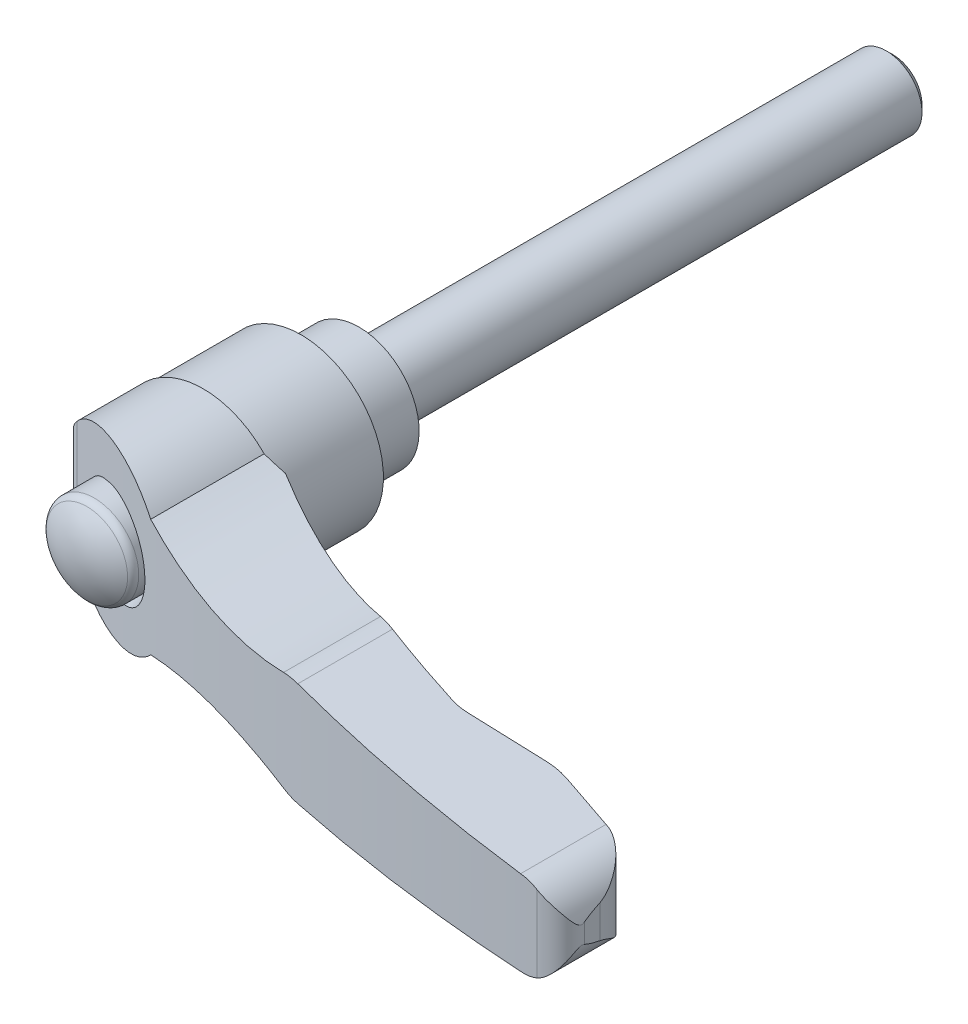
ISO-10303-21;
HEADER;
FILE_DESCRIPTION(('STEP AP214'),'2;1');
FILE_NAME('part.step','',(''),(''),'','','');
FILE_SCHEMA(('AUTOMOTIVE_DESIGN { 1 0 10303 214 1 1 1 1 }'));
ENDSEC;
DATA;
#1=APPLICATION_CONTEXT('core data for automotive mechanical design processes');
#2=APPLICATION_PROTOCOL_DEFINITION('international standard','automotive_design',2000,#1);
#3=PRODUCT_CONTEXT('',#1,'mechanical');
#4=PRODUCT('Part','Part','',(#3));
#5=PRODUCT_RELATED_PRODUCT_CATEGORY('part','',(#4));
#6=PRODUCT_DEFINITION_FORMATION('','',#4);
#7=PRODUCT_DEFINITION_CONTEXT('part definition',#1,'design');
#8=PRODUCT_DEFINITION('design','',#6,#7);
#9=PRODUCT_DEFINITION_SHAPE('','',#8);
#10=(LENGTH_UNIT() NAMED_UNIT(*) SI_UNIT(.MILLI.,.METRE.));
#11=(NAMED_UNIT(*) PLANE_ANGLE_UNIT() SI_UNIT($,.RADIAN.));
#12=(NAMED_UNIT(*) SI_UNIT($,.STERADIAN.) SOLID_ANGLE_UNIT());
#13=UNCERTAINTY_MEASURE_WITH_UNIT(LENGTH_MEASURE(1.E-05),#10,'distance_accuracy_value','');
#14=(GEOMETRIC_REPRESENTATION_CONTEXT(3) GLOBAL_UNCERTAINTY_ASSIGNED_CONTEXT((#13)) GLOBAL_UNIT_ASSIGNED_CONTEXT((#10,
#11,#12)) REPRESENTATION_CONTEXT('',''));
#15=CARTESIAN_POINT('',(0.,0.,0.));
#16=DIRECTION('',(0.,0.,1.));
#17=DIRECTION('',(1.,0.,0.));
#18=AXIS2_PLACEMENT_3D('',#15,#16,#17);
#19=CARTESIAN_POINT('',(0.,0.,-7.1165));
#20=DIRECTION('',(0.,0.,-1.));
#21=DIRECTION('',(0.,1.,0.));
#22=AXIS2_PLACEMENT_3D('',#19,#20,#21);
#23=CYLINDRICAL_SURFACE('',#22,4.);
#24=CARTESIAN_POINT('',(0.,0.,0.));
#25=DIRECTION('',(0.,0.,-1.));
#26=DIRECTION('',(0.,1.,0.));
#27=AXIS2_PLACEMENT_3D('',#24,#25,#26);
#28=CIRCLE('',#27,4.);
#29=CARTESIAN_POINT('',(0.,4.,0.));
#30=VERTEX_POINT('',#29);
#31=EDGE_CURVE('E17',#30,#30,#28,.F.);
#32=ORIENTED_EDGE('',*,*,#31,.F.);
#33=EDGE_LOOP('',(#32));
#34=FACE_BOUND('',#33,.T.);
#35=CARTESIAN_POINT('',(0.,0.,-59.2329999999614));
#36=DIRECTION('',(0.,0.,1.));
#37=DIRECTION('',(1.,0.,0.));
#38=AXIS2_PLACEMENT_3D('',#35,#36,#37);
#39=CIRCLE('',#38,4.);
#40=CARTESIAN_POINT('',(4.,0.,-59.2329999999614));
#41=VERTEX_POINT('',#40);
#42=EDGE_CURVE('E445',#41,#41,#39,.T.);
#43=ORIENTED_EDGE('',*,*,#42,.T.);
#44=EDGE_LOOP('',(#43));
#45=FACE_BOUND('',#44,.T.);
#46=ADVANCED_FACE('F14',(#34,#45),#23,.T.);
#47=CARTESIAN_POINT('',(5.375,0.,0.));
#48=DIRECTION('',(0.,0.,-1.));
#49=DIRECTION('',(0.,1.,0.));
#50=AXIS2_PLACEMENT_3D('',#47,#48,#49);
#51=PLANE('',#50);
#52=ORIENTED_EDGE('',*,*,#31,.T.);
#53=EDGE_LOOP('',(#52));
#54=FACE_BOUND('',#53,.T.);
#55=CARTESIAN_POINT('',(0.,0.,0.));
#56=DIRECTION('',(0.,0.,-1.));
#57=DIRECTION('',(0.,1.,0.));
#58=AXIS2_PLACEMENT_3D('',#55,#56,#57);
#59=CIRCLE('',#58,6.75);
#60=CARTESIAN_POINT('',(0.,6.75,0.));
#61=VERTEX_POINT('',#60);
#62=EDGE_CURVE('E194',#61,#61,#59,.F.);
#63=ORIENTED_EDGE('',*,*,#62,.F.);
#64=EDGE_LOOP('',(#63));
#65=FACE_BOUND('',#64,.T.);
#66=ADVANCED_FACE('F839',(#54,#65),#51,.T.);
#67=CARTESIAN_POINT('',(0.,0.,8.25));
#68=DIRECTION('',(0.,0.,-1.));
#69=DIRECTION('',(0.,1.,0.));
#70=AXIS2_PLACEMENT_3D('',#67,#68,#69);
#71=CYLINDRICAL_SURFACE('',#70,6.75);
#72=ORIENTED_EDGE('',*,*,#62,.T.);
#73=EDGE_LOOP('',(#72));
#74=FACE_BOUND('',#73,.T.);
#75=CARTESIAN_POINT('',(0.,0.,7.15000000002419));
#76=DIRECTION('',(0.,0.,-1.));
#77=DIRECTION('',(1.,0.,0.));
#78=AXIS2_PLACEMENT_3D('',#75,#76,#77);
#79=CIRCLE('',#78,6.74999999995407);
#80=CARTESIAN_POINT('',(6.74999999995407,0.,7.15000000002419));
#81=VERTEX_POINT('',#80);
#82=EDGE_CURVE('E192',#81,#81,#79,.T.);
#83=ORIENTED_EDGE('',*,*,#82,.T.);
#84=EDGE_LOOP('',(#83));
#85=FACE_BOUND('',#84,.T.);
#86=ADVANCED_FACE('F829',(#74,#85),#71,.T.);
#87=CARTESIAN_POINT('',(0.,0.,6.9000000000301));
#88=DIRECTION('',(0.,0.,-1.));
#89=DIRECTION('',(0.,1.,0.));
#90=AXIS2_PLACEMENT_3D('',#87,#88,#89);
#91=CONICAL_SURFACE('',#90,7.000000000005,0.785398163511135);
#92=ORIENTED_EDGE('',*,*,#82,.F.);
#93=EDGE_LOOP('',(#92));
#94=FACE_BOUND('',#93,.T.);
#95=CARTESIAN_POINT('',(0.,0.,6.9));
#96=DIRECTION('',(0.,0.,-1.));
#97=DIRECTION('',(0.,1.,0.));
#98=AXIS2_PLACEMENT_3D('',#95,#96,#97);
#99=CIRCLE('',#98,7.);
#100=CARTESIAN_POINT('',(0.,7.,6.9));
#101=VERTEX_POINT('',#100);
#102=EDGE_CURVE('E184',#101,#101,#99,.T.);
#103=ORIENTED_EDGE('',*,*,#102,.T.);
#104=EDGE_LOOP('',(#103));
#105=FACE_BOUND('',#104,.T.);
#106=ADVANCED_FACE('F819',(#94,#105),#91,.F.);
#107=CARTESIAN_POINT('',(0.,0.,6.2));
#108=DIRECTION('',(0.,0.,-1.));
#109=DIRECTION('',(0.,1.,0.));
#110=AXIS2_PLACEMENT_3D('',#107,#108,#109);
#111=CYLINDRICAL_SURFACE('',#110,7.);
#112=ORIENTED_EDGE('',*,*,#102,.F.);
#113=EDGE_LOOP('',(#112));
#114=FACE_BOUND('',#113,.T.);
#115=CARTESIAN_POINT('',(0.,0.,6.5));
#116=DIRECTION('',(0.,0.,-1.));
#117=DIRECTION('',(0.,1.,0.));
#118=AXIS2_PLACEMENT_3D('',#115,#116,#117);
#119=CIRCLE('',#118,7.);
#120=CARTESIAN_POINT('',(0.,7.,6.5));
#121=VERTEX_POINT('',#120);
#122=EDGE_CURVE('E181',#121,#121,#119,.F.);
#123=ORIENTED_EDGE('',*,*,#122,.F.);
#124=EDGE_LOOP('',(#123));
#125=FACE_BOUND('',#124,.T.);
#126=ADVANCED_FACE('F811',(#114,#125),#111,.F.);
#127=CARTESIAN_POINT('',(-9.01003775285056,-19.,6.5));
#128=DIRECTION('',(0.707106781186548,0.,0.707106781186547));
#129=DIRECTION('',(-0.707106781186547,0.,0.707106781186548));
#130=AXIS2_PLACEMENT_3D('',#127,#128,#129);
#131=PLANE('',#130);
#132=DIRECTION('',(0.,1.,0.));
#133=VECTOR('',#132,1.);
#134=CARTESIAN_POINT('',(-9.01003775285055,0.,6.5));
#135=LINE('',#134,#133);
#136=CARTESIAN_POINT('',(-9.01003775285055,-2.13584185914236,6.5));
#137=VERTEX_POINT('',#136);
#138=CARTESIAN_POINT('',(-9.01003775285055,2.13584185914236,6.5));
#139=VERTEX_POINT('',#138);
#140=EDGE_CURVE('E165',#137,#139,#135,.T.);
#141=ORIENTED_EDGE('',*,*,#140,.F.);
#142=CARTESIAN_POINT('',(-0.00999999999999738,0.,-2.50003775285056));
#143=DIRECTION('',(0.707106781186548,0.,0.707106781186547));
#144=DIRECTION('',(-0.707106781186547,0.,0.707106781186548));
#145=AXIS2_PLACEMENT_3D('',#142,#143,#144);
#146=ELLIPSE('',#145,13.0814754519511,9.25);
#147=EDGE_CURVE('E168',#139,#137,#146,.T.);
#148=ORIENTED_EDGE('',*,*,#147,.F.);
#149=EDGE_LOOP('',(#141,#148));
#150=FACE_BOUND('',#149,.T.);
#151=ADVANCED_FACE('F170',(#150),#131,.F.);
#152=CARTESIAN_POINT('',(-4.635,0.,6.5));
#153=DIRECTION('',(0.,0.,-1.));
#154=DIRECTION('',(0.,1.,0.));
#155=AXIS2_PLACEMENT_3D('',#152,#153,#154);
#156=PLANE('',#155);
#157=ORIENTED_EDGE('',*,*,#140,.T.);
#158=CARTESIAN_POINT('',(-0.00999999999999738,0.,6.5));
#159=DIRECTION('',(0.,0.,1.));
#160=DIRECTION('',(-1.,0.,0.));
#161=AXIS2_PLACEMENT_3D('',#158,#159,#160);
#162=CIRCLE('',#161,9.25);
#163=EDGE_CURVE('E172',#137,#139,#162,.T.);
#164=ORIENTED_EDGE('',*,*,#163,.F.);
#165=EDGE_LOOP('',(#157,#164));
#166=FACE_BOUND('',#165,.T.);
#167=ORIENTED_EDGE('',*,*,#122,.T.);
#168=EDGE_LOOP('',(#167));
#169=FACE_BOUND('',#168,.T.);
#170=ADVANCED_FACE('F179',(#166,#169),#156,.T.);
#171=CARTESIAN_POINT('',(-0.00999999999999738,0.,13.5625));
#172=DIRECTION('',(0.,0.,1.));
#173=DIRECTION('',(-1.,0.,0.));
#174=AXIS2_PLACEMENT_3D('',#171,#172,#173);
#175=CYLINDRICAL_SURFACE('',#174,9.25);
#176=ORIENTED_EDGE('',*,*,#163,.T.);
#177=ORIENTED_EDGE('',*,*,#147,.T.);
#178=EDGE_LOOP('',(#176,#177));
#179=FACE_BOUND('',#178,.T.);
#180=CARTESIAN_POINT('',(-0.00999999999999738,0.,17.5));
#181=DIRECTION('',(0.,0.,1.));
#182=DIRECTION('',(-1.,0.,0.));
#183=AXIS2_PLACEMENT_3D('',#180,#181,#182);
#184=CIRCLE('',#183,9.25);
#185=CARTESIAN_POINT('',(-9.26,0.,17.5));
#186=VERTEX_POINT('',#185);
#187=CARTESIAN_POINT('',(9.23999999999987,0.,17.5000000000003));
#188=VERTEX_POINT('',#187);
#189=EDGE_CURVE('E419',#186,#188,#184,.T.);
#190=ORIENTED_EDGE('',*,*,#189,.F.);
#191=CARTESIAN_POINT('',(-0.00999999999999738,0.,17.5));
#192=DIRECTION('',(0.,0.,1.));
#193=DIRECTION('',(-1.,0.,0.));
#194=AXIS2_PLACEMENT_3D('',#191,#192,#193);
#195=CIRCLE('',#194,9.25);
#196=EDGE_CURVE('E428',#188,#186,#195,.T.);
#197=ORIENTED_EDGE('',*,*,#196,.F.);
#198=EDGE_LOOP('',(#190,#197));
#199=FACE_BOUND('',#198,.T.);
#200=ADVANCED_FACE('F174',(#179,#199),#175,.T.);
#201=CARTESIAN_POINT('',(0.,0.,24.));
#202=DIRECTION('',(1.,0.,0.));
#203=DIRECTION('',(0.,0.,1.));
#204=AXIS2_PLACEMENT_3D('',#201,#202,#203);
#205=SPHERICAL_SURFACE('',#204,8.);
#206=CARTESIAN_POINT('',(0.,0.,30.5652144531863));
#207=DIRECTION('',(0.,0.,1.));
#208=DIRECTION('',(0.,-1.,0.));
#209=AXIS2_PLACEMENT_3D('',#206,#207,#208);
#210=CIRCLE('',#209,4.57142857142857);
#211=CARTESIAN_POINT('',(0.,-4.57142857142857,30.5652144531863));
#212=VERTEX_POINT('',#211);
#213=EDGE_CURVE('E403',#212,#212,#210,.F.);
#214=ORIENTED_EDGE('',*,*,#213,.F.);
#215=EDGE_LOOP('',(#214));
#216=FACE_BOUND('',#215,.T.);
#217=ADVANCED_FACE('F778',(#216),#205,.T.);
#218=CARTESIAN_POINT('',(64.6274051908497,-10.5,37.5817950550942));
#219=DIRECTION('',(0.992331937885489,0.,-0.123601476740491));
#220=DIRECTION('',(0.123601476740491,0.,0.992331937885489));
#221=AXIS2_PLACEMENT_3D('',#218,#219,#220);
#222=PLANE('',#221);
#223=CARTESIAN_POINT('',(60.25,0.,2.43788666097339));
#224=DIRECTION('',(0.992331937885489,0.,-0.123601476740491));
#225=DIRECTION('',(0.123601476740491,0.,0.992331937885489));
#226=AXIS2_PLACEMENT_3D('',#223,#224,#225);
#227=ELLIPSE('',#226,38.4299615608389,4.75);
#228=CARTESIAN_POINT('',(64.8745408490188,1.08449155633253,39.5659186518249));
#229=VERTEX_POINT('',#228);
#230=CARTESIAN_POINT('',(64.6274051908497,1.84413226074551,37.5817950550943));
#231=VERTEX_POINT('',#230);
#232=EDGE_CURVE('E555',#229,#231,#227,.F.);
#233=ORIENTED_EDGE('',*,*,#232,.F.);
#234=DIRECTION('',(0.,-1.,0.));
#235=VECTOR('',#234,1.);
#236=CARTESIAN_POINT('',(64.8745408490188,-10.5,39.5659186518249));
#237=LINE('',#236,#235);
#238=CARTESIAN_POINT('',(64.8745408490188,-1.08449155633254,39.5659186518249));
#239=VERTEX_POINT('',#238);
#240=EDGE_CURVE('E495',#239,#229,#237,.F.);
#241=ORIENTED_EDGE('',*,*,#240,.F.);
#242=CARTESIAN_POINT('',(60.25,0.,2.43788666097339));
#243=DIRECTION('',(0.992331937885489,0.,-0.123601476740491));
#244=DIRECTION('',(0.123601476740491,0.,0.992331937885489));
#245=AXIS2_PLACEMENT_3D('',#242,#243,#244);
#246=ELLIPSE('',#245,38.4299615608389,4.75);
#247=CARTESIAN_POINT('',(64.6274051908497,-1.84413226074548,37.5817950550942));
#248=VERTEX_POINT('',#247);
#249=EDGE_CURVE('E504',#248,#239,#246,.F.);
#250=ORIENTED_EDGE('',*,*,#249,.F.);
#251=DIRECTION('',(0.,-1.,0.));
#252=VECTOR('',#251,1.);
#253=CARTESIAN_POINT('',(64.6274051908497,-10.5,37.5817950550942));
#254=LINE('',#253,#252);
#255=EDGE_CURVE('E177',#231,#248,#254,.T.);
#256=ORIENTED_EDGE('',*,*,#255,.F.);
#257=EDGE_LOOP('',(#233,#241,#250,#256));
#258=FACE_BOUND('',#257,.T.);
#259=ADVANCED_FACE('F543',(#258),#222,.T.);
#260=CARTESIAN_POINT('',(58.6337202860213,-10.5,38.3283479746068));
#261=DIRECTION('',(0.,-1.,0.));
#262=DIRECTION('',(1.,0.,0.));
#263=AXIS2_PLACEMENT_3D('',#260,#261,#262);
#264=CYLINDRICAL_SURFACE('',#263,6.04);
#265=CARTESIAN_POINT('',(64.6274051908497,1.84413226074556,37.5817950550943));
#266=CARTESIAN_POINT('',(64.6175868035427,1.86745330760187,37.5030045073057));
#267=CARTESIAN_POINT('',(64.6063375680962,1.89362327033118,37.4253204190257));
#268=CARTESIAN_POINT('',(64.5811702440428,1.95049016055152,37.2721928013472));
#269=CARTESIAN_POINT('',(64.5672561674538,1.98118026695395,37.196746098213));
#270=CARTESIAN_POINT('',(64.5369883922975,2.04585034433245,37.0482136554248));
#271=CARTESIAN_POINT('',(64.520645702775,2.07981523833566,36.9751189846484));
#272=CARTESIAN_POINT('',(64.4855821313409,2.15032519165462,36.8307396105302));
#273=CARTESIAN_POINT('',(64.4668602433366,2.18687133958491,36.7594556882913));
#274=CARTESIAN_POINT('',(64.4072221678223,2.29938724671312,36.547961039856));
#275=CARTESIAN_POINT('',(64.3628565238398,2.37818379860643,36.410218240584));
#276=CARTESIAN_POINT('',(64.2652007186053,2.53960895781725,36.1400450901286));
#277=CARTESIAN_POINT('',(64.2118976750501,2.6222429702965,36.007622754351));
#278=CARTESIAN_POINT('',(64.077119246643,2.81672317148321,35.7040219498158));
#279=CARTESIAN_POINT('',(63.9921849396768,2.92909268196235,35.5347005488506));
#280=CARTESIAN_POINT('',(63.8063278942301,3.15216626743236,35.2039790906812));
#281=CARTESIAN_POINT('',(63.7054078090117,3.26287061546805,35.0425777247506));
#282=CARTESIAN_POINT('',(63.4870671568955,3.47959027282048,34.7278934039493));
#283=CARTESIAN_POINT('',(63.369645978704,3.58560540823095,34.5746107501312));
#284=CARTESIAN_POINT('',(63.1179209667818,3.7899652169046,34.277236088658));
#285=CARTESIAN_POINT('',(62.9836257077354,3.88831374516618,34.1331394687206));
#286=CARTESIAN_POINT('',(62.6561598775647,4.10136712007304,33.815313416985));
#287=CARTESIAN_POINT('',(62.4571888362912,4.2125890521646,33.6450495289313));
#288=CARTESIAN_POINT('',(62.1378586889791,4.36029911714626,33.4069452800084));
#289=CARTESIAN_POINT('',(62.0281124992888,4.40629516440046,33.330558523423));
#290=CARTESIAN_POINT('',(61.8018114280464,4.49098569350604,33.1841350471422));
#291=CARTESIAN_POINT('',(61.6852609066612,4.52968478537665,33.1140943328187));
#292=CARTESIAN_POINT('',(61.4786111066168,4.58924867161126,32.9993621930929));
#293=CARTESIAN_POINT('',(61.3900115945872,4.61209493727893,32.9529824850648));
#294=CARTESIAN_POINT('',(61.209734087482,4.65295056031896,32.8642982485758));
#295=CARTESIAN_POINT('',(61.1180570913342,4.67096147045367,32.82199241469));
#296=CARTESIAN_POINT('',(60.9313596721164,4.70183469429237,32.7415027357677));
#297=CARTESIAN_POINT('',(60.8363219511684,4.71466416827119,32.7033462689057));
#298=CARTESIAN_POINT('',(60.6438287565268,4.73463763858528,32.631712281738));
#299=CARTESIAN_POINT('',(60.5463713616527,4.74177695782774,32.5982386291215));
#300=CARTESIAN_POINT('',(60.4479724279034,4.74587261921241,32.5672639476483));
#301=B_SPLINE_CURVE_WITH_KNOTS('',3,(#265,#266,#267,#268,#269,#270,#271,#272,#273,#274,#275,
#276,#277,#278,#279,#280,#281,#282,#283,#284,#285,#286,#287,#288,#289,#290,#291,#292,#293,#294,
#295,#296,#297,#298,#299,#300),.UNSPECIFIED.,.F.,.F.,(4,2,2,2,2,2,2,2,2,2,2,2,2,2,2,2,2,4),(0.,
0.248076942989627,0.495783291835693,0.742399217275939,0.989119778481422,1.48293160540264,
1.97746142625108,2.63745339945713,3.29733594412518,3.95724294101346,4.61681594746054,
5.46693586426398,5.89075482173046,6.31430511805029,6.62183365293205,6.92926331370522,
7.23861197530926,7.54821464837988),.UNSPECIFIED.);
#302=CARTESIAN_POINT('',(60.4479724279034,4.74587261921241,32.5672639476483));
#303=VERTEX_POINT('',#302);
#304=EDGE_CURVE('E494',#231,#303,#301,.T.);
#305=ORIENTED_EDGE('',*,*,#304,.F.);
#306=ORIENTED_EDGE('',*,*,#255,.T.);
#307=CARTESIAN_POINT('',(60.4479724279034,-4.74587261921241,32.5672639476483));
#308=CARTESIAN_POINT('',(60.5755504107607,-4.74057354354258,32.6074069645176));
#309=CARTESIAN_POINT('',(60.7015088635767,-4.73014540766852,32.6517620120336));
#310=CARTESIAN_POINT('',(60.9490652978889,-4.69992242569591,32.7481786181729));
#311=CARTESIAN_POINT('',(61.0706698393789,-4.6801423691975,32.8002279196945));
#312=CARTESIAN_POINT('',(61.3074659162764,-4.63235500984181,32.9108206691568));
#313=CARTESIAN_POINT('',(61.4227141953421,-4.60444273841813,32.9692844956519));
#314=CARTESIAN_POINT('',(61.6477173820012,-4.54120548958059,33.0925213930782));
#315=CARTESIAN_POINT('',(61.7574696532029,-4.50587699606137,33.1572974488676));
#316=CARTESIAN_POINT('',(61.9940137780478,-4.42040174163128,33.307032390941));
#317=CARTESIAN_POINT('',(62.1193938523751,-4.36870213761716,33.3933358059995));
#318=CARTESIAN_POINT('',(62.3610721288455,-4.25718277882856,33.5732278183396));
#319=CARTESIAN_POINT('',(62.4773638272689,-4.19735729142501,33.6668215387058));
#320=CARTESIAN_POINT('',(62.7012840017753,-4.07066877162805,33.8608437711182));
#321=CARTESIAN_POINT('',(62.8088611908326,-4.00376876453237,33.9613071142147));
#322=CARTESIAN_POINT('',(63.0146476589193,-3.86453813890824,34.1677809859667));
#323=CARTESIAN_POINT('',(63.1128596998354,-3.79220913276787,34.2737898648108));
#324=CARTESIAN_POINT('',(63.3331746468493,-3.6170051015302,34.5290929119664));
#325=CARTESIAN_POINT('',(63.4514763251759,-3.51235864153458,34.6804594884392));
#326=CARTESIAN_POINT('',(63.6718053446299,-3.29808480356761,34.9913387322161));
#327=CARTESIAN_POINT('',(63.7738256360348,-3.18845529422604,35.1508548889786));
#328=CARTESIAN_POINT('',(63.961662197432,-2.96765680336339,35.4770445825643));
#329=CARTESIAN_POINT('',(64.0475378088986,-2.85649513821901,35.6436890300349));
#330=CARTESIAN_POINT('',(64.2038484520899,-2.63586419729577,35.9851508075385));
#331=CARTESIAN_POINT('',(64.2742871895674,-2.52639452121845,36.1599661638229));
#332=CARTESIAN_POINT('',(64.3705847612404,-2.36382517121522,36.4361542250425));
#333=CARTESIAN_POINT('',(64.4019853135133,-2.30809068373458,36.5340606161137));
#334=CARTESIAN_POINT('',(64.4601539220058,-2.20019362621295,36.7330390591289));
#335=CARTESIAN_POINT('',(64.4869269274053,-2.14802727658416,36.8341075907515));
#336=CARTESIAN_POINT('',(64.5357331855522,-2.0489078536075,37.0402846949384));
#337=CARTESIAN_POINT('',(64.5577546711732,-2.00196785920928,37.1454025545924));
#338=CARTESIAN_POINT('',(64.5966140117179,-1.91618262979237,37.360168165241));
#339=CARTESIAN_POINT('',(64.6134353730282,-1.87736327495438,37.4698291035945));
#340=CARTESIAN_POINT('',(64.6274051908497,-1.84413226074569,37.5817950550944));
#341=B_SPLINE_CURVE_WITH_KNOTS('',3,(#307,#308,#309,#310,#311,#312,#313,#314,#315,#316,#317,
#318,#319,#320,#321,#322,#323,#324,#325,#326,#327,#328,#329,#330,#331,#332,#333,#334,#335,#336,
#337,#338,#339,#340),.UNSPECIFIED.,.F.,.F.,(4,2,2,2,2,2,2,2,2,2,2,2,2,2,2,2,4),(0.,
0.401264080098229,0.801895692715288,1.19802151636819,1.5943355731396,2.07588331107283,
2.55777255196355,3.04231807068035,3.52672024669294,4.18208013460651,4.83772302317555,
5.49090678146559,6.14393356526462,6.4946438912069,6.84497677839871,7.19616755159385,
7.54846105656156),.UNSPECIFIED.);
#342=CARTESIAN_POINT('',(60.4479724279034,-4.74587261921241,32.5672639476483));
#343=VERTEX_POINT('',#342);
#344=EDGE_CURVE('E507',#343,#248,#341,.T.);
#345=ORIENTED_EDGE('',*,*,#344,.F.);
#346=DIRECTION('',(0.,-1.,0.));
#347=VECTOR('',#346,1.);
#348=CARTESIAN_POINT('',(60.4479724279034,-10.5,32.5672639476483));
#349=LINE('',#348,#347);
#350=EDGE_CURVE('E417',#303,#343,#349,.T.);
#351=ORIENTED_EDGE('',*,*,#350,.F.);
#352=EDGE_LOOP('',(#305,#306,#345,#351));
#353=FACE_BOUND('',#352,.T.);
#354=ADVANCED_FACE('F537',(#353),#264,.T.);
#355=CARTESIAN_POINT('',(-9.26,-10.5,17.5));
#356=DIRECTION('',(0.,0.,-1.));
#357=DIRECTION('',(0.,1.,0.));
#358=AXIS2_PLACEMENT_3D('',#355,#356,#357);
#359=PLANE('',#358);
#360=DIRECTION('',(0.,-1.,0.));
#361=VECTOR('',#360,1.);
#362=CARTESIAN_POINT('',(-9.26,-10.5,17.5));
#363=LINE('',#362,#361);
#364=CARTESIAN_POINT('',(-9.26,2.12188595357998,17.5));
#365=VERTEX_POINT('',#364);
#366=EDGE_CURVE('E426',#365,#186,#363,.T.);
#367=ORIENTED_EDGE('',*,*,#366,.F.);
#368=CARTESIAN_POINT('',(0.,0.,17.5));
#369=DIRECTION('',(0.,0.,1.));
#370=DIRECTION('',(0.,-1.,0.));
#371=AXIS2_PLACEMENT_3D('',#368,#369,#370);
#372=CIRCLE('',#371,9.5);
#373=CARTESIAN_POINT('',(6.8437408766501,6.58887022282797,17.5));
#374=VERTEX_POINT('',#373);
#375=EDGE_CURVE('E340',#374,#365,#372,.T.);
#376=ORIENTED_EDGE('',*,*,#375,.F.);
#377=CARTESIAN_POINT('',(19.25,44.09,17.5));
#378=DIRECTION('',(0.,0.,1.));
#379=DIRECTION('',(0.,-1.,0.));
#380=AXIS2_PLACEMENT_3D('',#377,#378,#379);
#381=CIRCLE('',#380,39.5);
#382=CARTESIAN_POINT('',(9.23999999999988,5.8794006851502,17.5000000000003));
#383=VERTEX_POINT('',#382);
#384=EDGE_CURVE('E300',#374,#383,#381,.T.);
#385=ORIENTED_EDGE('',*,*,#384,.T.);
#386=DIRECTION('',(0.,-1.,0.));
#387=VECTOR('',#386,1.);
#388=CARTESIAN_POINT('',(9.23999999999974,-10.5,17.5000000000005));
#389=LINE('',#388,#387);
#390=EDGE_CURVE('E406',#383,#188,#389,.T.);
#391=ORIENTED_EDGE('',*,*,#390,.T.);
#392=ORIENTED_EDGE('',*,*,#196,.T.);
#393=EDGE_LOOP('',(#367,#376,#385,#391,#392));
#394=FACE_BOUND('',#393,.T.);
#395=ADVANCED_FACE('F542',(#394),#359,.T.);
#396=CARTESIAN_POINT('',(-9.26,-10.5,21.2038249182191));
#397=DIRECTION('',(-1.,0.,0.));
#398=DIRECTION('',(0.,-1.,0.));
#399=AXIS2_PLACEMENT_3D('',#396,#397,#398);
#400=PLANE('',#399);
#401=ORIENTED_EDGE('',*,*,#366,.T.);
#402=DIRECTION('',(0.,1.,0.));
#403=VECTOR('',#402,1.);
#404=CARTESIAN_POINT('',(-9.26,-10.5,17.5));
#405=LINE('',#404,#403);
#406=CARTESIAN_POINT('',(-9.26,-2.12188595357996,17.5));
#407=VERTEX_POINT('',#406);
#408=EDGE_CURVE('E420',#407,#186,#405,.T.);
#409=ORIENTED_EDGE('',*,*,#408,.F.);
#410=DIRECTION('',(0.,0.,1.));
#411=VECTOR('',#410,1.);
#412=CARTESIAN_POINT('',(-9.26,-2.12188595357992,42.5));
#413=LINE('',#412,#411);
#414=CARTESIAN_POINT('',(-9.26,-2.12188595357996,21.2038249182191));
#415=VERTEX_POINT('',#414);
#416=EDGE_CURVE('E423',#415,#407,#413,.F.);
#417=ORIENTED_EDGE('',*,*,#416,.F.);
#418=DIRECTION('',(0.,-1.,0.));
#419=VECTOR('',#418,1.);
#420=CARTESIAN_POINT('',(-9.26,-10.5,21.2038249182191));
#421=LINE('',#420,#419);
#422=CARTESIAN_POINT('',(-9.26,2.12188595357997,21.2038249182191));
#423=VERTEX_POINT('',#422);
#424=EDGE_CURVE('E475',#423,#415,#421,.T.);
#425=ORIENTED_EDGE('',*,*,#424,.F.);
#426=DIRECTION('',(0.,0.,1.));
#427=VECTOR('',#426,1.);
#428=CARTESIAN_POINT('',(-9.26,2.12188595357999,42.5));
#429=LINE('',#428,#427);
#430=EDGE_CURVE('E343',#365,#423,#429,.T.);
#431=ORIENTED_EDGE('',*,*,#430,.F.);
#432=EDGE_LOOP('',(#401,#409,#417,#425,#431));
#433=FACE_BOUND('',#432,.T.);
#434=ADVANCED_FACE('F740',(#433),#400,.T.);
#435=CARTESIAN_POINT('',(-9.26,-10.5,17.5));
#436=DIRECTION('',(0.,0.,-1.));
#437=DIRECTION('',(0.,1.,0.));
#438=AXIS2_PLACEMENT_3D('',#435,#436,#437);
#439=PLANE('',#438);
#440=DIRECTION('',(0.,-1.,0.));
#441=VECTOR('',#440,1.);
#442=CARTESIAN_POINT('',(9.23999999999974,-10.5,17.5000000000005));
#443=LINE('',#442,#441);
#444=CARTESIAN_POINT('',(9.23999999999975,-5.87940068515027,17.5000000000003));
#445=VERTEX_POINT('',#444);
#446=EDGE_CURVE('E404',#188,#445,#443,.T.);
#447=ORIENTED_EDGE('',*,*,#446,.T.);
#448=CARTESIAN_POINT('',(19.25,-44.09,17.5));
#449=DIRECTION('',(0.,0.,1.));
#450=DIRECTION('',(0.,-1.,0.));
#451=AXIS2_PLACEMENT_3D('',#448,#449,#450);
#452=CIRCLE('',#451,39.5);
#453=CARTESIAN_POINT('',(6.84374087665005,-6.588870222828,17.5));
#454=VERTEX_POINT('',#453);
#455=EDGE_CURVE('E474',#445,#454,#452,.T.);
#456=ORIENTED_EDGE('',*,*,#455,.T.);
#457=CARTESIAN_POINT('',(0.,0.,17.5));
#458=DIRECTION('',(0.,0.,1.));
#459=DIRECTION('',(0.,-1.,0.));
#460=AXIS2_PLACEMENT_3D('',#457,#458,#459);
#461=CIRCLE('',#460,9.5);
#462=EDGE_CURVE('E478',#407,#454,#461,.T.);
#463=ORIENTED_EDGE('',*,*,#462,.F.);
#464=ORIENTED_EDGE('',*,*,#408,.T.);
#465=ORIENTED_EDGE('',*,*,#189,.T.);
#466=EDGE_LOOP('',(#447,#456,#463,#464,#465));
#467=FACE_BOUND('',#466,.T.);
#468=ADVANCED_FACE('F732',(#467),#439,.T.);
#469=CARTESIAN_POINT('',(53.8294507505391,-10.5,30.4829917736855));
#470=DIRECTION('',(0.300372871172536,0.,-0.953821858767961));
#471=DIRECTION('',(0.953821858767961,0.,0.300372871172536));
#472=AXIS2_PLACEMENT_3D('',#469,#470,#471);
#473=PLANE('',#472);
#474=CARTESIAN_POINT('',(60.25,0.,32.5049194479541));
#475=DIRECTION('',(0.300372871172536,0.,-0.953821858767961));
#476=DIRECTION('',(0.953821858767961,0.,0.300372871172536));
#477=AXIS2_PLACEMENT_3D('',#474,#475,#476);
#478=ELLIPSE('',#477,4.97996555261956,4.75);
#479=CARTESIAN_POINT('',(60.25,4.75,32.5049194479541));
#480=VERTEX_POINT('',#479);
#481=EDGE_CURVE('E496',#303,#480,#478,.F.);
#482=ORIENTED_EDGE('',*,*,#481,.F.);
#483=ORIENTED_EDGE('',*,*,#350,.T.);
#484=CARTESIAN_POINT('',(60.25,0.,32.5049194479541));
#485=DIRECTION('',(0.300372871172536,0.,-0.953821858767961));
#486=DIRECTION('',(0.953821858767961,0.,0.300372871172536));
#487=AXIS2_PLACEMENT_3D('',#484,#485,#486);
#488=ELLIPSE('',#487,4.97996555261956,4.75);
#489=CARTESIAN_POINT('',(60.25,-4.75,32.5049194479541));
#490=VERTEX_POINT('',#489);
#491=EDGE_CURVE('E536',#490,#343,#488,.F.);
#492=ORIENTED_EDGE('',*,*,#491,.F.);
#493=DIRECTION('',(-0.953255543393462,-0.0344545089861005,-0.300194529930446));
#494=VECTOR('',#493,1.);
#495=CARTESIAN_POINT('',(60.25,-4.75,32.5049194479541));
#496=LINE('',#495,#494);
#497=CARTESIAN_POINT('',(53.8294507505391,-4.98206460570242,30.4829917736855));
#498=VERTEX_POINT('',#497);
#499=EDGE_CURVE('E464',#490,#498,#496,.T.);
#500=ORIENTED_EDGE('',*,*,#499,.T.);
#501=DIRECTION('',(0.,-1.,0.));
#502=VECTOR('',#501,1.);
#503=CARTESIAN_POINT('',(53.8294507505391,-10.5,30.4829917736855));
#504=LINE('',#503,#502);
#505=CARTESIAN_POINT('',(53.8294507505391,4.98206460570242,30.4829917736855));
#506=VERTEX_POINT('',#505);
#507=EDGE_CURVE('E414',#506,#498,#504,.T.);
#508=ORIENTED_EDGE('',*,*,#507,.F.);
#509=DIRECTION('',(0.953255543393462,-0.0344545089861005,0.300194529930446));
#510=VECTOR('',#509,1.);
#511=CARTESIAN_POINT('',(53.8294507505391,4.98206460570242,30.4829917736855));
#512=LINE('',#511,#510);
#513=EDGE_CURVE('E299',#506,#480,#512,.T.);
#514=ORIENTED_EDGE('',*,*,#513,.T.);
#515=EDGE_LOOP('',(#482,#483,#492,#500,#508,#514));
#516=FACE_BOUND('',#515,.T.);
#517=ADVANCED_FACE('F573',(#516),#473,.T.);
#518=CARTESIAN_POINT('',(51.0780352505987,-10.5,39.22));
#519=DIRECTION('',(0.,-1.,0.));
#520=DIRECTION('',(1.,0.,0.));
#521=AXIS2_PLACEMENT_3D('',#518,#519,#520);
#522=CYLINDRICAL_SURFACE('',#521,9.15999999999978);
#523=CARTESIAN_POINT('',(51.0780352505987,5.08151188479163,39.22));
#524=DIRECTION('',(-0.0361204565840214,-0.999347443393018,0.));
#525=DIRECTION('',(0.999347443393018,-0.0361204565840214,0.));
#526=AXIS2_PLACEMENT_3D('',#523,#524,#525);
#527=ELLIPSE('',#526,9.16598132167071,9.15999999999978);
#528=CARTESIAN_POINT('',(51.0780352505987,5.08151188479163,30.06));
#529=VERTEX_POINT('',#528);
#530=EDGE_CURVE('E302',#529,#506,#527,.T.);
#531=ORIENTED_EDGE('',*,*,#530,.T.);
#532=ORIENTED_EDGE('',*,*,#507,.T.);
#533=CARTESIAN_POINT('',(51.0780352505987,-5.08151188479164,39.22));
#534=DIRECTION('',(-0.0361204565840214,0.999347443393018,0.));
#535=DIRECTION('',(-0.999347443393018,-0.0361204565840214,0.));
#536=AXIS2_PLACEMENT_3D('',#533,#534,#535);
#537=ELLIPSE('',#536,9.16598132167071,9.15999999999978);
#538=CARTESIAN_POINT('',(51.0780352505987,-5.08151188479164,30.06));
#539=VERTEX_POINT('',#538);
#540=EDGE_CURVE('E463',#498,#539,#537,.T.);
#541=ORIENTED_EDGE('',*,*,#540,.T.);
#542=DIRECTION('',(0.,1.,0.));
#543=VECTOR('',#542,1.);
#544=CARTESIAN_POINT('',(51.0780352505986,-10.5,30.06));
#545=LINE('',#544,#543);
#546=EDGE_CURVE('E411',#529,#539,#545,.F.);
#547=ORIENTED_EDGE('',*,*,#546,.F.);
#548=EDGE_LOOP('',(#531,#532,#541,#547));
#549=FACE_BOUND('',#548,.T.);
#550=ADVANCED_FACE('F716',(#549),#522,.T.);
#551=CARTESIAN_POINT('',(42.239481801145,-10.5,30.06));
#552=DIRECTION('',(0.,0.,-1.));
#553=DIRECTION('',(0.,1.,0.));
#554=AXIS2_PLACEMENT_3D('',#551,#552,#553);
#555=PLANE('',#554);
#556=DIRECTION('',(0.999347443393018,-0.0361204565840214,0.));
#557=VECTOR('',#556,1.);
#558=CARTESIAN_POINT('',(30.3472861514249,5.83080496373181,30.06));
#559=LINE('',#558,#557);
#560=CARTESIAN_POINT('',(42.239481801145,5.4009729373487,30.06));
#561=VERTEX_POINT('',#560);
#562=EDGE_CURVE('E488',#561,#529,#559,.T.);
#563=ORIENTED_EDGE('',*,*,#562,.T.);
#564=ORIENTED_EDGE('',*,*,#546,.T.);
#565=DIRECTION('',(-0.999347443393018,-0.0361204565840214,0.));
#566=VECTOR('',#565,1.);
#567=CARTESIAN_POINT('',(60.25,-4.75,30.06));
#568=LINE('',#567,#566);
#569=CARTESIAN_POINT('',(42.239481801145,-5.4009729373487,30.06));
#570=VERTEX_POINT('',#569);
#571=EDGE_CURVE('E460',#539,#570,#568,.T.);
#572=ORIENTED_EDGE('',*,*,#571,.T.);
#573=DIRECTION('',(0.,-1.,0.));
#574=VECTOR('',#573,1.);
#575=CARTESIAN_POINT('',(42.239481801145,-10.5,30.06));
#576=LINE('',#575,#574);
#577=EDGE_CURVE('E409',#570,#561,#576,.F.);
#578=ORIENTED_EDGE('',*,*,#577,.T.);
#579=EDGE_LOOP('',(#563,#564,#572,#578));
#580=FACE_BOUND('',#579,.T.);
#581=ADVANCED_FACE('F708',(#580),#555,.T.);
#582=CARTESIAN_POINT('',(42.2394818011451,-10.5,23.0799999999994));
#583=DIRECTION('',(0.,-1.,0.));
#584=DIRECTION('',(1.,0.,0.));
#585=AXIS2_PLACEMENT_3D('',#582,#583,#584);
#586=CYLINDRICAL_SURFACE('',#585,6.98000000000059);
#587=DIRECTION('',(0.,-1.,0.));
#588=VECTOR('',#587,1.);
#589=CARTESIAN_POINT('',(40.3024609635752,-10.5,29.785844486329));
#590=LINE('',#589,#588);
#591=CARTESIAN_POINT('',(40.3024609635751,-5.47098470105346,29.7858444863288));
#592=VERTEX_POINT('',#591);
#593=CARTESIAN_POINT('',(40.3024609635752,5.47098470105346,29.7858444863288));
#594=VERTEX_POINT('',#593);
#595=EDGE_CURVE('E401',#592,#594,#590,.F.);
#596=ORIENTED_EDGE('',*,*,#595,.T.);
#597=CARTESIAN_POINT('',(42.2394818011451,5.40097293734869,23.0799999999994));
#598=DIRECTION('',(-0.0361204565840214,-0.999347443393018,0.));
#599=DIRECTION('',(0.999347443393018,-0.0361204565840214,0.));
#600=AXIS2_PLACEMENT_3D('',#597,#598,#599);
#601=ELLIPSE('',#600,6.98455781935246,6.98000000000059);
#602=EDGE_CURVE('E491',#594,#561,#601,.F.);
#603=ORIENTED_EDGE('',*,*,#602,.T.);
#604=ORIENTED_EDGE('',*,*,#577,.F.);
#605=CARTESIAN_POINT('',(42.2394818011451,-5.4009729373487,23.0799999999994));
#606=DIRECTION('',(-0.0361204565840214,0.999347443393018,0.));
#607=DIRECTION('',(-0.999347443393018,-0.0361204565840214,0.));
#608=AXIS2_PLACEMENT_3D('',#605,#606,#607);
#609=ELLIPSE('',#608,6.98455781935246,6.98000000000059);
#610=EDGE_CURVE('E462',#570,#592,#609,.F.);
#611=ORIENTED_EDGE('',*,*,#610,.T.);
#612=EDGE_LOOP('',(#596,#603,#604,#611));
#613=FACE_BOUND('',#612,.T.);
#614=ADVANCED_FACE('F310',(#613),#586,.F.);
#615=CARTESIAN_POINT('',(88.9416647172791,-10.5,-138.600024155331));
#616=DIRECTION('',(0.,-1.,0.));
#617=DIRECTION('',(1.,0.,0.));
#618=AXIS2_PLACEMENT_3D('',#615,#616,#617);
#619=CYLINDRICAL_SURFACE('',#618,175.27);
#620=CARTESIAN_POINT('',(30.3472861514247,5.83080496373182,26.5855433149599));
#621=CARTESIAN_POINT('',(30.1696679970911,5.83722947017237,26.5225405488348));
#622=CARTESIAN_POINT('',(29.9919650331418,5.83772087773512,26.45918181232));
#623=CARTESIAN_POINT('',(29.6377732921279,5.82691956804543,26.3322542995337));
#624=CARTESIAN_POINT('',(29.461282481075,5.81567269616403,26.2686872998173));
#625=CARTESIAN_POINT('',(29.1095062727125,5.78152581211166,26.1413510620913));
#626=CARTESIAN_POINT('',(28.9342208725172,5.75862582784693,26.0775818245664));
#627=CARTESIAN_POINT('',(28.5848474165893,5.70116062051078,25.9498538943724));
#628=CARTESIAN_POINT('',(28.4107667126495,5.6665501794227,25.8858954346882));
#629=CARTESIAN_POINT('',(28.2379732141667,5.62616845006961,25.8220994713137));
#630=B_SPLINE_CURVE_WITH_KNOTS('',3,(#620,#621,#622,#623,#624,#625,#626,#627,#628,#629),
.UNSPECIFIED.,.F.,.F.,(4,2,2,2,4),(0.,0.565613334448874,1.1290258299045,1.69243697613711,
2.2580489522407),.UNSPECIFIED.);
#631=CARTESIAN_POINT('',(30.3472861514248,5.83080496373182,26.5855433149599));
#632=VERTEX_POINT('',#631);
#633=CARTESIAN_POINT('',(28.2379732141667,5.62616845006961,25.8220994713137));
#634=VERTEX_POINT('',#633);
#635=EDGE_CURVE('E290',#632,#634,#630,.T.);
#636=ORIENTED_EDGE('',*,*,#635,.F.);
#637=CARTESIAN_POINT('',(88.9416647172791,3.71296724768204,-138.600024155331));
#638=DIRECTION('',(-0.0361204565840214,-0.999347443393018,0.));
#639=DIRECTION('',(0.999347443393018,-0.0361204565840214,0.));
#640=AXIS2_PLACEMENT_3D('',#637,#638,#639);
#641=ELLIPSE('',#640,175.384448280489,175.27);
#642=EDGE_CURVE('E493',#632,#594,#641,.F.);
#643=ORIENTED_EDGE('',*,*,#642,.T.);
#644=ORIENTED_EDGE('',*,*,#595,.F.);
#645=CARTESIAN_POINT('',(88.9416647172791,-3.71296724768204,-138.600024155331));
#646=DIRECTION('',(-0.0361204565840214,0.999347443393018,0.));
#647=DIRECTION('',(-0.999347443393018,-0.0361204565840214,0.));
#648=AXIS2_PLACEMENT_3D('',#645,#646,#647);
#649=ELLIPSE('',#648,175.384448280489,175.27);
#650=CARTESIAN_POINT('',(30.3472861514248,-5.83080496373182,26.5855433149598));
#651=VERTEX_POINT('',#650);
#652=EDGE_CURVE('E396',#592,#651,#649,.F.);
#653=ORIENTED_EDGE('',*,*,#652,.T.);
#654=CARTESIAN_POINT('',(28.237973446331,-5.6261685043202,25.8220995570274));
#655=CARTESIAN_POINT('',(28.4107669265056,-5.66655022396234,25.8858955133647));
#656=CARTESIAN_POINT('',(28.584847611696,-5.70116065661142,25.9498539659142));
#657=CARTESIAN_POINT('',(28.9342210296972,-5.75862584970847,26.0775818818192));
#658=CARTESIAN_POINT('',(29.1095064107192,-5.78152582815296,26.1413511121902));
#659=CARTESIAN_POINT('',(29.461282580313,-5.81567270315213,26.2686873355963));
#660=CARTESIAN_POINT('',(29.6377733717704,-5.82691957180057,26.3322543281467));
#661=CARTESIAN_POINT('',(29.9919650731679,-5.83772087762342,26.4591818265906));
#662=CARTESIAN_POINT('',(30.169668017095,-5.83722946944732,26.5225405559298));
#663=CARTESIAN_POINT('',(30.3472861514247,-5.83080496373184,26.5855433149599));
#664=B_SPLINE_CURVE_WITH_KNOTS('',3,(#654,#655,#656,#657,#658,#659,#660,#661,#662,#663),
.UNSPECIFIED.,.F.,.F.,(4,2,2,2,4),(0.,0.565611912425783,1.12902299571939,1.69243542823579,
2.25804869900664),.UNSPECIFIED.);
#665=CARTESIAN_POINT('',(28.237973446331,-5.6261685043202,25.8220995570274));
#666=VERTEX_POINT('',#665);
#667=EDGE_CURVE('E327',#666,#651,#664,.T.);
#668=ORIENTED_EDGE('',*,*,#667,.F.);
#669=CARTESIAN_POINT('',(28.237973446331,-5.6261685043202,25.8220995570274));
#670=CARTESIAN_POINT('',(27.6467124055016,-5.48799745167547,25.6038196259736));
#671=CARTESIAN_POINT('',(27.0537779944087,-5.3638308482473,25.3812778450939));
#672=CARTESIAN_POINT('',(25.8659006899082,-5.14331117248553,24.9280288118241));
#673=CARTESIAN_POINT('',(25.2709579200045,-5.04695642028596,24.6973220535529));
#674=CARTESIAN_POINT('',(24.0803912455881,-4.88185687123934,24.2280988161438));
#675=CARTESIAN_POINT('',(23.4847674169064,-4.81310925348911,23.9895831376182));
#676=CARTESIAN_POINT('',(22.2940534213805,-4.70292970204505,23.5051335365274));
#677=CARTESIAN_POINT('',(21.6989632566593,-4.66149787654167,23.2591995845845));
#678=CARTESIAN_POINT('',(19.93823636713,-4.57874286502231,22.520112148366));
#679=CARTESIAN_POINT('',(18.7748149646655,-4.57591682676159,22.0168726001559));
#680=CARTESIAN_POINT('',(16.4631439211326,-4.67145944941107,20.9870607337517));
#681=CARTESIAN_POINT('',(15.3148886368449,-4.76978933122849,20.4604974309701));
#682=CARTESIAN_POINT('',(13.7610005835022,-4.97097993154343,19.7276539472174));
#683=CARTESIAN_POINT('',(13.3455946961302,-5.03153416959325,19.5297267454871));
#684=CARTESIAN_POINT('',(12.518128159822,-5.16561835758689,19.1314774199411));
#685=CARTESIAN_POINT('',(12.1060667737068,-5.23914536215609,18.9311558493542));
#686=CARTESIAN_POINT('',(11.282699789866,-5.39957122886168,18.526898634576));
#687=CARTESIAN_POINT('',(10.8714191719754,-5.48655913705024,18.3229475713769));
#688=CARTESIAN_POINT('',(10.0527171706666,-5.67338492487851,17.9129677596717));
#689=CARTESIAN_POINT('',(9.64529662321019,-5.77322552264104,17.7069385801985));
#690=CARTESIAN_POINT('',(9.23999999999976,-5.87940068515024,17.5000000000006));
#691=B_SPLINE_CURVE_WITH_KNOTS('',3,(#669,#670,#671,#672,#673,#674,#675,#676,#677,#678,#679,
#680,#681,#682,#683,#684,#685,#686,#687,#688,#689,#690),.UNSPECIFIED.,.F.,.F.,(4,2,2,2,2,2,2,2,
2,2,4),(0.,1.93549726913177,3.87087760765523,5.80606013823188,7.74125033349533,11.5393004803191,
15.3358951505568,16.7281050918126,18.1199993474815,19.5215293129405,20.9233561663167),.UNSPECIFIED.);
#692=EDGE_CURVE('E318',#666,#445,#691,.T.);
#693=ORIENTED_EDGE('',*,*,#692,.T.);
#694=ORIENTED_EDGE('',*,*,#446,.F.);
#695=ORIENTED_EDGE('',*,*,#390,.F.);
#696=CARTESIAN_POINT('',(9.23999999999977,5.87940068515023,17.5000000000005));
#697=CARTESIAN_POINT('',(9.79948003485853,5.73283344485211,17.7856672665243));
#698=CARTESIAN_POINT('',(10.363016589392,5.59833643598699,18.0695987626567));
#699=CARTESIAN_POINT('',(11.4974282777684,5.35391463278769,18.6334448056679));
#700=CARTESIAN_POINT('',(12.068303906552,5.24399150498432,18.9133590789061));
#701=CARTESIAN_POINT('',(13.2171050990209,5.04907387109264,19.4688580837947));
#702=CARTESIAN_POINT('',(13.795037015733,4.9641038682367,19.7444383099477));
#703=CARTESIAN_POINT('',(14.9564491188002,4.81968144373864,20.2904183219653));
#704=CARTESIAN_POINT('',(15.5399291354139,4.7602282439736,20.56081826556));
#705=CARTESIAN_POINT('',(17.2745449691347,4.62260622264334,21.3530632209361));
#706=CARTESIAN_POINT('',(18.4324989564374,4.58133087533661,21.8669029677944));
#707=CARTESIAN_POINT('',(20.7578250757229,4.60168529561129,22.8686662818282));
#708=CARTESIAN_POINT('',(21.9251896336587,4.66323920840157,23.3566086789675));
#709=CARTESIAN_POINT('',(23.5210667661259,4.81923174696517,24.0035807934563));
#710=CARTESIAN_POINT('',(23.9492706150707,4.86815261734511,24.1752006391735));
#711=CARTESIAN_POINT('',(24.8053597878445,4.98022825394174,24.5144113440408));
#712=CARTESIAN_POINT('',(25.2332451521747,5.04338070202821,24.6820028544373));
#713=CARTESIAN_POINT('',(26.0913485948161,5.18451987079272,25.01422907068));
#714=CARTESIAN_POINT('',(26.5215612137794,5.26261039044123,25.1788336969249));
#715=CARTESIAN_POINT('',(27.3808010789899,5.43340909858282,25.5037362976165));
#716=CARTESIAN_POINT('',(27.8098280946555,5.52611995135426,25.6640334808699));
#717=CARTESIAN_POINT('',(28.2379732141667,5.6261684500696,25.8220994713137));
#718=B_SPLINE_CURVE_WITH_KNOTS('',3,(#696,#697,#698,#699,#700,#701,#702,#703,#704,#705,#706,
#707,#708,#709,#710,#711,#712,#713,#714,#715,#716,#717),.UNSPECIFIED.,.F.,.F.,(4,2,2,2,2,2,2,2,
2,2,4),(0.,1.93506781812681,3.87026682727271,5.80735983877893,7.74439377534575,11.5423680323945,
15.3375418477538,16.7290777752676,18.1203872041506,19.5217406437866,20.9233497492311),.UNSPECIFIED.);
#719=EDGE_CURVE('E333',#383,#634,#718,.T.);
#720=ORIENTED_EDGE('',*,*,#719,.T.);
#721=EDGE_LOOP('',(#636,#643,#644,#653,#668,#693,#694,#695,#720));
#722=FACE_BOUND('',#721,.T.);
#723=ADVANCED_FACE('F304',(#722),#619,.F.);
#724=CARTESIAN_POINT('',(0.,0.,29.744562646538));
#725=DIRECTION('',(0.,0.,1.));
#726=DIRECTION('',(0.,-1.,0.));
#727=AXIS2_PLACEMENT_3D('',#724,#725,#726);
#728=TOROIDAL_SURFACE('',#727,4.,1.);
#729=CARTESIAN_POINT('',(0.,0.,29.744562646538));
#730=DIRECTION('',(0.,0.,-1.));
#731=DIRECTION('',(0.,1.,0.));
#732=AXIS2_PLACEMENT_3D('',#729,#730,#731);
#733=CIRCLE('',#732,5.);
#734=CARTESIAN_POINT('',(0.,5.,29.744562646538));
#735=VERTEX_POINT('',#734);
#736=EDGE_CURVE('E390',#735,#735,#733,.T.);
#737=ORIENTED_EDGE('',*,*,#736,.F.);
#738=EDGE_LOOP('',(#737));
#739=FACE_BOUND('',#738,.T.);
#740=ORIENTED_EDGE('',*,*,#213,.T.);
#741=EDGE_LOOP('',(#740));
#742=FACE_BOUND('',#741,.T.);
#743=ADVANCED_FACE('F309',(#739,#742),#728,.T.);
#744=CARTESIAN_POINT('',(60.25,0.,42.5));
#745=DIRECTION('',(0.,0.,1.));
#746=DIRECTION('',(0.,-1.,0.));
#747=AXIS2_PLACEMENT_3D('',#744,#745,#746);
#748=CYLINDRICAL_SURFACE('',#747,4.75);
#749=ORIENTED_EDGE('',*,*,#249,.T.);
#750=CARTESIAN_POINT('',(62.2749077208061,-4.29677189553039,42.276905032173));
#751=CARTESIAN_POINT('',(62.3484429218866,-4.26213869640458,42.2829554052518));
#752=CARTESIAN_POINT('',(62.4212610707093,-4.22549552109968,42.2855470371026));
#753=CARTESIAN_POINT('',(62.564774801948,-4.14860038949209,42.2843574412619));
#754=CARTESIAN_POINT('',(62.6354735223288,-4.10835415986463,42.2805861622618));
#755=CARTESIAN_POINT('',(62.7735534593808,-4.02500028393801,42.2673020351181));
#756=CARTESIAN_POINT('',(62.8409620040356,-3.98192770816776,42.2578508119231));
#757=CARTESIAN_POINT('',(62.9729170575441,-3.8928858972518,42.2338060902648));
#758=CARTESIAN_POINT('',(63.0374621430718,-3.84691524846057,42.2192100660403));
#759=CARTESIAN_POINT('',(63.1798156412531,-3.7401232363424,42.1810015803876));
#760=CARTESIAN_POINT('',(63.2566999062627,-3.6785524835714,42.1560308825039));
#761=CARTESIAN_POINT('',(63.4051883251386,-3.55201688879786,42.099741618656));
#762=CARTESIAN_POINT('',(63.4767890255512,-3.48704987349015,42.0684189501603));
#763=CARTESIAN_POINT('',(63.684137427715,-3.28726383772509,41.9659030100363));
#764=CARTESIAN_POINT('',(63.811716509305,-3.14810402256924,41.8863686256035));
#765=CARTESIAN_POINT('',(64.0078346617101,-2.90809595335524,41.738770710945));
#766=CARTESIAN_POINT('',(64.0822428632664,-2.80914674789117,41.6751098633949));
#767=CARTESIAN_POINT('',(64.2213033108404,-2.60884800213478,41.5411877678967));
#768=CARTESIAN_POINT('',(64.2859552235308,-2.50749837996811,41.4709262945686));
#769=CARTESIAN_POINT('',(64.4056344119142,-2.30372384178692,41.3246959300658));
#770=CARTESIAN_POINT('',(64.4606832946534,-2.2013019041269,41.2487404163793));
#771=CARTESIAN_POINT('',(64.5615971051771,-1.99640423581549,41.091141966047));
#772=CARTESIAN_POINT('',(64.6074681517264,-1.89392858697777,41.0095028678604));
#773=CARTESIAN_POINT('',(64.6724899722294,-1.73436568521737,40.8759658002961));
#774=CARTESIAN_POINT('',(64.6946729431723,-1.6766282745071,40.8262975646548));
#775=CARTESIAN_POINT('',(64.7361015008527,-1.56239438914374,40.7242511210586));
#776=CARTESIAN_POINT('',(64.7553449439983,-1.50589884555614,40.6718709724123));
#777=CARTESIAN_POINT('',(64.7911041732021,-1.39440450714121,40.5626124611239));
#778=CARTESIAN_POINT('',(64.807565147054,-1.33945042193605,40.5056705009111));
#779=CARTESIAN_POINT('',(64.8370703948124,-1.23458164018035,40.3864037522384));
#780=CARTESIAN_POINT('',(64.8501220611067,-1.18465618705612,40.3240910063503));
#781=CARTESIAN_POINT('',(64.8661549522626,-1.11985818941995,40.2264927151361));
#782=CARTESIAN_POINT('',(64.8707942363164,-1.10049352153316,40.1945209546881));
#783=CARTESIAN_POINT('',(64.8789586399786,-1.06562552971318,40.1283652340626));
#784=CARTESIAN_POINT('',(64.8824848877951,-1.05011829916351,40.0941835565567));
#785=CARTESIAN_POINT('',(64.8876748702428,-1.02693288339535,40.0295882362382));
#786=CARTESIAN_POINT('',(64.889552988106,-1.01837321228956,39.9995179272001));
#787=CARTESIAN_POINT('',(64.8921785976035,-1.00633880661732,39.9383655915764));
#788=CARTESIAN_POINT('',(64.8929291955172,-1.00285010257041,39.9072865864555));
#789=CARTESIAN_POINT('',(64.89321534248,-1.00152501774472,39.8449093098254));
#790=CARTESIAN_POINT('',(64.8927474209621,-1.00370478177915,39.8136106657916));
#791=CARTESIAN_POINT('',(64.8906454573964,-1.01337643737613,39.7517827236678));
#792=CARTESIAN_POINT('',(64.8890063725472,-1.0208912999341,39.7212573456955));
#793=CARTESIAN_POINT('',(64.8852969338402,-1.03758048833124,39.6696465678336));
#794=CARTESIAN_POINT('',(64.8834575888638,-1.04578030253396,39.6482116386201));
#795=CARTESIAN_POINT('',(64.8793233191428,-1.06393290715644,39.6063556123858));
#796=CARTESIAN_POINT('',(64.8770324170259,-1.0738701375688,39.5859274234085));
#797=CARTESIAN_POINT('',(64.8745408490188,-1.0844915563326,39.5659186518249));
#798=B_SPLINE_CURVE_WITH_KNOTS('',3,(#750,#751,#752,#753,#754,#755,#756,#757,#758,#759,#760,
#761,#762,#763,#764,#765,#766,#767,#768,#769,#770,#771,#772,#773,#774,#775,#776,#777,#778,#779,
#780,#781,#782,#783,#784,#785,#786,#787,#788,#789,#790,#791,#792,#793,#794,#795,#796,#797),
.UNSPECIFIED.,.F.,.F.,(4,2,2,2,2,2,2,2,2,2,2,2,2,2,2,2,2,2,2,2,2,2,2,4),(0.,0.244350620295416,
0.488319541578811,0.729688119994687,0.97117536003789,1.27556052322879,1.58014290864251,
2.19203994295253,2.60923519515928,3.02644469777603,3.44270300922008,3.85868287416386,
4.09658232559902,4.33465444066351,4.57697559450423,4.81876687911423,4.93157965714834,
5.04427771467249,5.13787391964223,5.23121179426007,5.32481580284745,5.41882529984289,
5.48780546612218,5.55619684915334),.UNSPECIFIED.);
#799=CARTESIAN_POINT('',(62.2749077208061,-4.2967718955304,42.2769050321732));
#800=VERTEX_POINT('',#799);
#801=EDGE_CURVE('E497',#800,#239,#798,.T.);
#802=ORIENTED_EDGE('',*,*,#801,.F.);
#803=CARTESIAN_POINT('',(60.25,-4.75,42.1009088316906));
#804=CARTESIAN_POINT('',(60.3850127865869,-4.75001526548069,42.1132857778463));
#805=CARTESIAN_POINT('',(60.5200387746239,-4.74424440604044,42.1255330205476));
#806=CARTESIAN_POINT('',(60.7892105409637,-4.72122523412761,42.149694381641));
#807=CARTESIAN_POINT('',(60.9233558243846,-4.70397094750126,42.1616083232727));
#808=CARTESIAN_POINT('',(61.1873029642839,-4.65849581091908,42.1848041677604));
#809=CARTESIAN_POINT('',(61.3171394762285,-4.63047940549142,42.1960936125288));
#810=CARTESIAN_POINT('',(61.5739811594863,-4.56367863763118,42.2181964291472));
#811=CARTESIAN_POINT('',(61.7009880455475,-4.52490099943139,42.2290100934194));
#812=CARTESIAN_POINT('',(61.9022195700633,-4.45411922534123,42.2459686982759));
#813=CARTESIAN_POINT('',(61.977610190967,-4.42542278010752,42.2522814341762));
#814=CARTESIAN_POINT('',(62.1272657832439,-4.36405214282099,42.2647350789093));
#815=CARTESIAN_POINT('',(62.201522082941,-4.33135656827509,42.2708748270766));
#816=CARTESIAN_POINT('',(62.2749077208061,-4.29677189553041,42.2769050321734));
#817=B_SPLINE_CURVE_WITH_KNOTS('',3,(#803,#804,#805,#806,#807,#808,#809,#810,#811,#812,#813,
#814,#815,#816),.UNSPECIFIED.,.F.,.F.,(4,2,2,2,2,2,4),(0.,0.406617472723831,0.813446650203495,
1.2129017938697,1.6121078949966,1.8547546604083,2.09876071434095),.UNSPECIFIED.);
#818=CARTESIAN_POINT('',(60.25,-4.75,42.1009088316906));
#819=VERTEX_POINT('',#818);
#820=EDGE_CURVE('E394',#819,#800,#817,.T.);
#821=ORIENTED_EDGE('',*,*,#820,.F.);
#822=DIRECTION('',(0.,0.,1.));
#823=VECTOR('',#822,1.);
#824=CARTESIAN_POINT('',(60.25,-4.75,42.5));
#825=LINE('',#824,#823);
#826=EDGE_CURVE('E466',#819,#490,#825,.F.);
#827=ORIENTED_EDGE('',*,*,#826,.T.);
#828=ORIENTED_EDGE('',*,*,#491,.T.);
#829=ORIENTED_EDGE('',*,*,#344,.T.);
#830=EDGE_LOOP('',(#749,#802,#821,#827,#828,#829));
#831=FACE_BOUND('',#830,.T.);
#832=ADVANCED_FACE('F518',(#831),#748,.T.);
#833=CARTESIAN_POINT('',(62.4730975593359,-10.5,39.8650342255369));
#834=DIRECTION('',(0.,-1.,0.));
#835=DIRECTION('',(1.,0.,0.));
#836=AXIS2_PLACEMENT_3D('',#833,#834,#835);
#837=CYLINDRICAL_SURFACE('',#836,2.42);
#838=CARTESIAN_POINT('',(62.2749077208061,4.29677189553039,42.276905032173));
#839=CARTESIAN_POINT('',(62.3484429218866,4.26213869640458,42.2829554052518));
#840=CARTESIAN_POINT('',(62.4212610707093,4.22549552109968,42.2855470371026));
#841=CARTESIAN_POINT('',(62.564774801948,4.14860038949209,42.2843574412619));
#842=CARTESIAN_POINT('',(62.6354735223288,4.10835415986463,42.2805861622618));
#843=CARTESIAN_POINT('',(62.7735534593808,4.02500028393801,42.2673020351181));
#844=CARTESIAN_POINT('',(62.8409620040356,3.98192770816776,42.2578508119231));
#845=CARTESIAN_POINT('',(62.9729170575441,3.8928858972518,42.2338060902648));
#846=CARTESIAN_POINT('',(63.0374621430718,3.84691524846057,42.2192100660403));
#847=CARTESIAN_POINT('',(63.1798156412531,3.7401232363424,42.1810015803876));
#848=CARTESIAN_POINT('',(63.2566999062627,3.6785524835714,42.1560308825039));
#849=CARTESIAN_POINT('',(63.4051883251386,3.55201688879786,42.099741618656));
#850=CARTESIAN_POINT('',(63.4767890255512,3.48704987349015,42.0684189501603));
#851=CARTESIAN_POINT('',(63.684137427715,3.28726383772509,41.9659030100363));
#852=CARTESIAN_POINT('',(63.811716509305,3.14810402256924,41.8863686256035));
#853=CARTESIAN_POINT('',(64.0078346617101,2.90809595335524,41.738770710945));
#854=CARTESIAN_POINT('',(64.0822428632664,2.80914674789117,41.6751098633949));
#855=CARTESIAN_POINT('',(64.2213033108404,2.60884800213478,41.5411877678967));
#856=CARTESIAN_POINT('',(64.2859552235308,2.50749837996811,41.4709262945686));
#857=CARTESIAN_POINT('',(64.4056344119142,2.30372384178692,41.3246959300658));
#858=CARTESIAN_POINT('',(64.4606832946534,2.2013019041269,41.2487404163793));
#859=CARTESIAN_POINT('',(64.5615971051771,1.99640423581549,41.091141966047));
#860=CARTESIAN_POINT('',(64.6074681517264,1.89392858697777,41.0095028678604));
#861=CARTESIAN_POINT('',(64.6724899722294,1.73436568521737,40.8759658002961));
#862=CARTESIAN_POINT('',(64.6946729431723,1.6766282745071,40.8262975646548));
#863=CARTESIAN_POINT('',(64.7361015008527,1.56239438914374,40.7242511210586));
#864=CARTESIAN_POINT('',(64.7553449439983,1.50589884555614,40.6718709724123));
#865=CARTESIAN_POINT('',(64.7911041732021,1.39440450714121,40.5626124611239));
#866=CARTESIAN_POINT('',(64.807565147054,1.33945042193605,40.5056705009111));
#867=CARTESIAN_POINT('',(64.8370703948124,1.23458164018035,40.3864037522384));
#868=CARTESIAN_POINT('',(64.8501220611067,1.18465618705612,40.3240910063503));
#869=CARTESIAN_POINT('',(64.8661549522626,1.11985818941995,40.2264927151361));
#870=CARTESIAN_POINT('',(64.8707942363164,1.10049352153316,40.1945209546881));
#871=CARTESIAN_POINT('',(64.8789586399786,1.06562552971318,40.1283652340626));
#872=CARTESIAN_POINT('',(64.8824848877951,1.05011829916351,40.0941835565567));
#873=CARTESIAN_POINT('',(64.8876748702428,1.02693288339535,40.0295882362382));
#874=CARTESIAN_POINT('',(64.889552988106,1.01837321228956,39.9995179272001));
#875=CARTESIAN_POINT('',(64.8921785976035,1.00633880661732,39.9383655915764));
#876=CARTESIAN_POINT('',(64.8929291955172,1.00285010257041,39.9072865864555));
#877=CARTESIAN_POINT('',(64.89321534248,1.00152501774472,39.8449093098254));
#878=CARTESIAN_POINT('',(64.8927474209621,1.00370478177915,39.8136106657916));
#879=CARTESIAN_POINT('',(64.8906454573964,1.01337643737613,39.7517827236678));
#880=CARTESIAN_POINT('',(64.8890063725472,1.0208912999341,39.7212573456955));
#881=CARTESIAN_POINT('',(64.8852969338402,1.03758048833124,39.6696465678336));
#882=CARTESIAN_POINT('',(64.8834575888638,1.04578030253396,39.6482116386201));
#883=CARTESIAN_POINT('',(64.8793233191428,1.06393290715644,39.6063556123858));
#884=CARTESIAN_POINT('',(64.8770324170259,1.0738701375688,39.5859274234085));
#885=CARTESIAN_POINT('',(64.8745408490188,1.0844915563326,39.5659186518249));
#886=B_SPLINE_CURVE_WITH_KNOTS('',3,(#838,#839,#840,#841,#842,#843,#844,#845,#846,#847,#848,
#849,#850,#851,#852,#853,#854,#855,#856,#857,#858,#859,#860,#861,#862,#863,#864,#865,#866,#867,
#868,#869,#870,#871,#872,#873,#874,#875,#876,#877,#878,#879,#880,#881,#882,#883,#884,#885),
.UNSPECIFIED.,.F.,.F.,(4,2,2,2,2,2,2,2,2,2,2,2,2,2,2,2,2,2,2,2,2,2,2,4),(0.,0.244350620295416,
0.488319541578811,0.729688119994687,0.97117536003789,1.27556052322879,1.58014290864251,
2.19203994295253,2.60923519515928,3.02644469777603,3.44270300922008,3.85868287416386,
4.09658232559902,4.33465444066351,4.57697559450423,4.81876687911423,4.93157965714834,
5.04427771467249,5.13787391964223,5.23121179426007,5.32481580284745,5.41882529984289,
5.48780546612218,5.55619684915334),.UNSPECIFIED.);
#887=CARTESIAN_POINT('',(62.2749077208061,4.2967718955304,42.2769050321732));
#888=VERTEX_POINT('',#887);
#889=EDGE_CURVE('E502',#888,#229,#886,.T.);
#890=ORIENTED_EDGE('',*,*,#889,.F.);
#891=DIRECTION('',(0.,-1.,0.));
#892=VECTOR('',#891,1.);
#893=CARTESIAN_POINT('',(62.2749077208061,-10.5,42.2769050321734));
#894=LINE('',#893,#892);
#895=EDGE_CURVE('E455',#800,#888,#894,.F.);
#896=ORIENTED_EDGE('',*,*,#895,.F.);
#897=ORIENTED_EDGE('',*,*,#801,.T.);
#898=ORIENTED_EDGE('',*,*,#240,.T.);
#899=EDGE_LOOP('',(#890,#896,#897,#898));
#900=FACE_BOUND('',#899,.T.);
#901=ADVANCED_FACE('F516',(#900),#837,.T.);
#902=CARTESIAN_POINT('',(60.25,0.,42.5));
#903=DIRECTION('',(0.,0.,1.));
#904=DIRECTION('',(0.,-1.,0.));
#905=AXIS2_PLACEMENT_3D('',#902,#903,#904);
#906=CYLINDRICAL_SURFACE('',#905,4.75);
#907=ORIENTED_EDGE('',*,*,#232,.T.);
#908=ORIENTED_EDGE('',*,*,#304,.T.);
#909=ORIENTED_EDGE('',*,*,#481,.T.);
#910=DIRECTION('',(0.,0.,1.));
#911=VECTOR('',#910,1.);
#912=CARTESIAN_POINT('',(60.25,4.75,42.5));
#913=LINE('',#912,#911);
#914=CARTESIAN_POINT('',(60.25,4.75,42.1009088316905));
#915=VERTEX_POINT('',#914);
#916=EDGE_CURVE('E492',#480,#915,#913,.T.);
#917=ORIENTED_EDGE('',*,*,#916,.T.);
#918=CARTESIAN_POINT('',(62.2749077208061,4.29677189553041,42.2769050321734));
#919=CARTESIAN_POINT('',(62.1526074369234,4.35442457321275,42.2668563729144));
#920=CARTESIAN_POINT('',(62.027854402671,4.40681781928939,42.2564990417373));
#921=CARTESIAN_POINT('',(61.7743193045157,4.50079963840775,42.2352210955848));
#922=CARTESIAN_POINT('',(61.6455353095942,4.54238294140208,42.2243002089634));
#923=CARTESIAN_POINT('',(61.3872932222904,4.61375080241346,42.2021612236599));
#924=CARTESIAN_POINT('',(61.2578894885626,4.6437352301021,42.1909520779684));
#925=CARTESIAN_POINT('',(60.9971282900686,4.69274765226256,42.1681230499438));
#926=CARTESIAN_POINT('',(60.8657720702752,4.71178234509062,42.1565034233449));
#927=CARTESIAN_POINT('',(60.6537297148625,4.73349762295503,42.1375484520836));
#928=CARTESIAN_POINT('',(60.5733751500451,4.7396643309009,42.1303200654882));
#929=CARTESIAN_POINT('',(60.412016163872,4.74792732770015,42.1157134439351));
#930=CARTESIAN_POINT('',(60.3310106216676,4.75000065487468,42.1083345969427));
#931=CARTESIAN_POINT('',(60.25,4.75,42.1009088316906));
#932=B_SPLINE_CURVE_WITH_KNOTS('',3,(#918,#919,#920,#921,#922,#923,#924,#925,#926,#927,#928,
#929,#930,#931),.UNSPECIFIED.,.F.,.F.,(4,2,2,2,2,2,4),(0.,0.406619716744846,0.813437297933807,
1.21289403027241,1.61210613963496,1.8547544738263,2.09876011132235),.UNSPECIFIED.);
#933=EDGE_CURVE('E221',#888,#915,#932,.T.);
#934=ORIENTED_EDGE('',*,*,#933,.F.);
#935=ORIENTED_EDGE('',*,*,#889,.T.);
#936=EDGE_LOOP('',(#907,#908,#909,#917,#934,#935));
#937=FACE_BOUND('',#936,.T.);
#938=ADVANCED_FACE('F556',(#937),#906,.T.);
#939=CARTESIAN_POINT('',(30.3472861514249,5.83080496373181,42.5));
#940=DIRECTION('',(-0.0361204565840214,-0.999347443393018,0.));
#941=DIRECTION('',(0.999347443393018,-0.0361204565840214,0.));
#942=AXIS2_PLACEMENT_3D('',#939,#940,#941);
#943=PLANE('',#942);
#944=ORIENTED_EDGE('',*,*,#530,.F.);
#945=ORIENTED_EDGE('',*,*,#562,.F.);
#946=ORIENTED_EDGE('',*,*,#602,.F.);
#947=ORIENTED_EDGE('',*,*,#642,.F.);
#948=DIRECTION('',(0.,0.,1.));
#949=VECTOR('',#948,1.);
#950=CARTESIAN_POINT('',(30.3472861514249,5.83080496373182,42.5));
#951=LINE('',#950,#949);
#952=CARTESIAN_POINT('',(30.3472861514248,5.83080496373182,37.2241685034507));
#953=VERTEX_POINT('',#952);
#954=EDGE_CURVE('E298',#953,#632,#951,.F.);
#955=ORIENTED_EDGE('',*,*,#954,.F.);
#956=CARTESIAN_POINT('',(79.948199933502,4.03802742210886,-172.7981859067));
#957=DIRECTION('',(-0.0361204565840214,-0.999347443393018,0.));
#958=DIRECTION('',(0.999347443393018,-0.0361204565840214,0.));
#959=AXIS2_PLACEMENT_3D('',#956,#957,#958);
#960=ELLIPSE('',#959,215.940913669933,215.8);
#961=EDGE_CURVE('E279',#915,#953,#960,.T.);
#962=ORIENTED_EDGE('',*,*,#961,.F.);
#963=ORIENTED_EDGE('',*,*,#916,.F.);
#964=ORIENTED_EDGE('',*,*,#513,.F.);
#965=EDGE_LOOP('',(#944,#945,#946,#947,#955,#962,#963,#964));
#966=FACE_BOUND('',#965,.T.);
#967=ADVANCED_FACE('F285',(#966),#943,.F.);
#968=CARTESIAN_POINT('',(30.0583224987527,-2.16397458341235,42.5));
#969=DIRECTION('',(0.,0.,1.));
#970=DIRECTION('',(0.,-1.,0.));
#971=AXIS2_PLACEMENT_3D('',#968,#969,#970);
#972=CYLINDRICAL_SURFACE('',#971,8.);
#973=CARTESIAN_POINT('',(30.3472861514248,5.83080496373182,37.2241685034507));
#974=CARTESIAN_POINT('',(30.1697645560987,5.83722808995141,37.1822446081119));
#975=CARTESIAN_POINT('',(29.9920959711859,5.83772255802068,37.1400457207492));
#976=CARTESIAN_POINT('',(29.6379436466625,5.82692706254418,37.0554559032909));
#977=CARTESIAN_POINT('',(29.4614580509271,5.81568603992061,37.0130664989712));
#978=CARTESIAN_POINT('',(29.1096637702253,5.78154479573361,36.928102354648));
#979=CARTESIAN_POINT('',(28.9343550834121,5.75864459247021,36.8855276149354));
#980=CARTESIAN_POINT('',(28.5849091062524,5.70117409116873,36.8002038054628));
#981=CARTESIAN_POINT('',(28.4107797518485,5.66655551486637,36.7574547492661));
#982=CARTESIAN_POINT('',(28.2379732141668,5.62616845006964,36.7148028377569));
#983=B_SPLINE_CURVE_WITH_KNOTS('',3,(#973,#974,#975,#976,#977,#978,#979,#980,#981,#982),
.UNSPECIFIED.,.F.,.F.,(4,2,2,2,4),(0.,0.547453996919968,1.09263401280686,1.63781317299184,
2.18526630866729),.UNSPECIFIED.);
#984=CARTESIAN_POINT('',(28.2379732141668,5.62616845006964,36.714802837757));
#985=VERTEX_POINT('',#984);
#986=EDGE_CURVE('E272',#953,#985,#983,.T.);
#987=ORIENTED_EDGE('',*,*,#986,.F.);
#988=ORIENTED_EDGE('',*,*,#954,.T.);
#989=ORIENTED_EDGE('',*,*,#635,.T.);
#990=DIRECTION('',(0.,0.,1.));
#991=VECTOR('',#990,1.);
#992=CARTESIAN_POINT('',(28.2379732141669,5.62616845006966,42.5));
#993=LINE('',#992,#991);
#994=EDGE_CURVE('E482',#634,#985,#993,.T.);
#995=ORIENTED_EDGE('',*,*,#994,.T.);
#996=EDGE_LOOP('',(#987,#988,#989,#995));
#997=FACE_BOUND('',#996,.T.);
#998=ADVANCED_FACE('F280',(#997),#972,.T.);
#999=CARTESIAN_POINT('',(19.25,44.09,42.5));
#1000=DIRECTION('',(0.,0.,1.));
#1001=DIRECTION('',(0.,-1.,0.));
#1002=AXIS2_PLACEMENT_3D('',#999,#1000,#1001);
#1003=CYLINDRICAL_SURFACE('',#1002,39.5);
#1004=ORIENTED_EDGE('',*,*,#384,.F.);
#1005=DIRECTION('',(0.,0.,1.));
#1006=VECTOR('',#1005,1.);
#1007=CARTESIAN_POINT('',(6.84374087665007,6.58887022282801,42.5));
#1008=LINE('',#1007,#1006);
#1009=CARTESIAN_POINT('',(6.84374087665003,6.58887022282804,30.2421501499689));
#1010=VERTEX_POINT('',#1009);
#1011=EDGE_CURVE('E353',#1010,#374,#1008,.F.);
#1012=ORIENTED_EDGE('',*,*,#1011,.F.);
#1013=CARTESIAN_POINT('',(28.2379732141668,5.62616845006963,36.7148028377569));
#1014=CARTESIAN_POINT('',(27.6682570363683,5.49303214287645,36.5741969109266));
#1015=CARTESIAN_POINT('',(27.096301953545,5.37273903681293,36.4305600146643));
#1016=CARTESIAN_POINT('',(25.9490941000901,5.15784722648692,36.1374174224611));
#1017=CARTESIAN_POINT('',(25.3738414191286,5.0632478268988,35.9879118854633));
#1018=CARTESIAN_POINT('',(24.2212057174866,4.89974680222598,35.6832223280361));
#1019=CARTESIAN_POINT('',(23.6438227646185,4.8308443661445,35.528038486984));
#1020=CARTESIAN_POINT('',(22.4880975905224,4.71866668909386,35.2122361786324));
#1021=CARTESIAN_POINT('',(21.9097553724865,4.67539136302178,35.0516177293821));
#1022=CARTESIAN_POINT('',(20.2001196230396,4.58518828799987,34.5690900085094));
#1023=CARTESIAN_POINT('',(19.0688077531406,4.574324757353,34.2397910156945));
#1024=CARTESIAN_POINT('',(16.8150559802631,4.64900465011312,33.5637051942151));
#1025=CARTESIAN_POINT('',(15.6926136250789,4.73452041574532,33.2169234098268));
#1026=CARTESIAN_POINT('',(13.9229387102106,4.94528995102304,32.6544330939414));
#1027=CARTESIAN_POINT('',(13.270341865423,5.03968179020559,32.4435501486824));
#1028=CARTESIAN_POINT('',(11.9722268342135,5.26066415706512,32.0172761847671));
#1029=CARTESIAN_POINT('',(11.3267071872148,5.38724790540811,31.8018861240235));
#1030=CARTESIAN_POINT('',(10.0356458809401,5.67400513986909,31.3643601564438));
#1031=CARTESIAN_POINT('',(9.39021472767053,5.83459695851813,31.1421728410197));
#1032=CARTESIAN_POINT('',(8.10920891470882,6.18783091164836,30.6944696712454));
#1033=CARTESIAN_POINT('',(7.47363611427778,6.38047901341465,30.4689532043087));
#1034=CARTESIAN_POINT('',(6.84374087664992,6.58887022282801,30.2421501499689));
#1035=B_SPLINE_CURVE_WITH_KNOTS('',3,(#1013,#1014,#1015,#1016,#1017,#1018,#1019,#1020,#1021,
#1022,#1023,#1024,#1025,#1026,#1027,#1028,#1029,#1030,#1031,#1032,#1033,#1034),.UNSPECIFIED.,
.F.,.F.,(4,2,2,2,2,2,2,2,2,2,4),(0.,1.80500142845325,3.60995400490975,5.41484961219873,
7.21973922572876,10.7502186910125,14.2796852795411,16.3558417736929,18.4315614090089,
20.5344750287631,22.637780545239),.UNSPECIFIED.);
#1036=EDGE_CURVE('E265',#985,#1010,#1035,.T.);
#1037=ORIENTED_EDGE('',*,*,#1036,.F.);
#1038=ORIENTED_EDGE('',*,*,#994,.F.);
#1039=ORIENTED_EDGE('',*,*,#719,.F.);
#1040=EDGE_LOOP('',(#1004,#1012,#1037,#1038,#1039));
#1041=FACE_BOUND('',#1040,.T.);
#1042=ADVANCED_FACE('F284',(#1041),#1003,.F.);
#1043=CARTESIAN_POINT('',(0.,0.,42.5));
#1044=DIRECTION('',(0.,0.,1.));
#1045=DIRECTION('',(0.,-1.,0.));
#1046=AXIS2_PLACEMENT_3D('',#1043,#1044,#1045);
#1047=CYLINDRICAL_SURFACE('',#1046,9.5);
#1048=CARTESIAN_POINT('',(6.84374087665,6.58887022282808,30.2421501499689));
#1049=CARTESIAN_POINT('',(6.6508004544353,6.78931825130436,30.1726847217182));
#1050=CARTESIAN_POINT('',(6.44961303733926,6.98062511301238,30.0999344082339));
#1051=CARTESIAN_POINT('',(6.03270358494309,7.34389134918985,29.9484251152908));
#1052=CARTESIAN_POINT('',(5.81698706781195,7.51585800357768,29.8696684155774));
#1053=CARTESIAN_POINT('',(5.37345447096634,7.83907665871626,29.7068832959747));
#1054=CARTESIAN_POINT('',(5.14567410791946,7.99038552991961,29.6228703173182));
#1055=CARTESIAN_POINT('',(4.67931603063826,8.27213483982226,29.4499214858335));
#1056=CARTESIAN_POINT('',(4.44073748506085,8.40257366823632,29.3609852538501));
#1057=CARTESIAN_POINT('',(3.95497881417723,8.64183737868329,29.178885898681));
#1058=CARTESIAN_POINT('',(3.70781056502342,8.75069080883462,29.0857285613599));
#1059=CARTESIAN_POINT('',(3.20629853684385,8.9466280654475,28.8956228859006));
#1060=CARTESIAN_POINT('',(2.9519521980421,9.03370401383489,28.7986731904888));
#1061=CARTESIAN_POINT('',(2.43786340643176,9.18578796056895,28.6015746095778));
#1062=CARTESIAN_POINT('',(2.17811924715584,9.25078886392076,28.5014247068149));
#1063=CARTESIAN_POINT('',(1.65503418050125,9.3585350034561,28.2985542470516));
#1064=CARTESIAN_POINT('',(1.39169304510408,9.40127882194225,28.1958335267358));
#1065=CARTESIAN_POINT('',(0.85074504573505,9.46593151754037,27.9835884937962));
#1066=CARTESIAN_POINT('',(0.57304691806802,9.48677267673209,27.8739706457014));
#1067=CARTESIAN_POINT('',(0.0174543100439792,9.50404900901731,27.6533175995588));
#1068=CARTESIAN_POINT('',(-0.260440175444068,9.50048351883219,27.5422823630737));
#1069=CARTESIAN_POINT('',(-0.814707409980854,9.46907255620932,27.3194845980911));
#1070=CARTESIAN_POINT('',(-1.0910794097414,9.44121604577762,27.2077217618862));
#1071=CARTESIAN_POINT('',(-1.64035574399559,9.36142371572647,26.9842845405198));
#1072=CARTESIAN_POINT('',(-1.91326010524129,9.30948808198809,26.8726101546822));
#1073=CARTESIAN_POINT('',(-2.46330450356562,9.17958373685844,26.6462310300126));
#1074=CARTESIAN_POINT('',(-2.74025729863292,9.10076570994,26.5315574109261));
#1075=CARTESIAN_POINT('',(-3.28644549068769,8.91808146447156,26.3041026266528));
#1076=CARTESIAN_POINT('',(-3.55568366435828,8.81422438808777,26.1913207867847));
#1077=CARTESIAN_POINT('',(-4.08433646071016,8.58204223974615,25.9686498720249));
#1078=CARTESIAN_POINT('',(-4.34375951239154,8.45373876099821,25.8587583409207));
#1079=CARTESIAN_POINT('',(-4.85090228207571,8.17329327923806,25.6428084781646));
#1080=CARTESIAN_POINT('',(-5.09862572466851,8.0211589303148,25.5367489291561));
#1081=CARTESIAN_POINT('',(-5.63245900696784,7.65837288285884,25.3070697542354));
#1082=CARTESIAN_POINT('',(-5.91533954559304,7.44217556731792,25.1845902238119));
#1083=CARTESIAN_POINT('',(-6.32150789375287,7.09368737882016,25.0077780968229));
#1084=CARTESIAN_POINT('',(-6.45385516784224,6.97351060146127,24.9499993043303));
#1085=CARTESIAN_POINT('',(-6.71211253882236,6.72529570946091,24.8369579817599));
#1086=CARTESIAN_POINT('',(-6.83802218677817,6.59725704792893,24.7816956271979));
#1087=CARTESIAN_POINT('',(-6.96050280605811,6.46540027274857,24.7278057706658));
#1088=B_SPLINE_CURVE_WITH_KNOTS('',3,(#1048,#1049,#1050,#1051,#1052,#1053,#1054,#1055,#1056,
#1057,#1058,#1059,#1060,#1061,#1062,#1063,#1064,#1065,#1066,#1067,#1068,#1069,#1070,#1071,#1072,
#1073,#1074,#1075,#1076,#1077,#1078,#1079,#1080,#1081,#1082,#1083,#1084,#1085,#1086,#1087),
.UNSPECIFIED.,.F.,.F.,(4,2,2,2,2,2,2,2,2,2,2,2,2,2,2,2,2,2,2,4),(0.,0.859932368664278,
1.71953995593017,2.57673116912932,3.43398848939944,4.29010435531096,5.14652947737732,
6.00322959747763,6.85998427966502,7.75680139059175,8.65364287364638,9.55089209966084,
10.4481343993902,11.3768514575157,12.3052299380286,13.2327921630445,14.1600570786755,
15.2871100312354,15.8504832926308,16.4138957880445),.UNSPECIFIED.);
#1089=CARTESIAN_POINT('',(-6.96050280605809,6.46540027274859,24.7278057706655));
#1090=VERTEX_POINT('',#1089);
#1091=EDGE_CURVE('E258',#1010,#1090,#1088,.T.);
#1092=ORIENTED_EDGE('',*,*,#1091,.F.);
#1093=ORIENTED_EDGE('',*,*,#1011,.T.);
#1094=ORIENTED_EDGE('',*,*,#375,.T.);
#1095=ORIENTED_EDGE('',*,*,#430,.T.);
#1096=CARTESIAN_POINT('',(-6.96050280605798,6.46540027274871,24.7278057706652));
#1097=CARTESIAN_POINT('',(-7.03231779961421,6.38808599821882,24.6962037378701));
#1098=CARTESIAN_POINT('',(-7.1024464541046,6.31000340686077,24.6627326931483));
#1099=CARTESIAN_POINT('',(-7.23932687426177,6.15248181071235,24.5923336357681));
#1100=CARTESIAN_POINT('',(-7.30607941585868,6.07304312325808,24.5554064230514));
#1101=CARTESIAN_POINT('',(-7.50117682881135,5.83307908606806,24.4399205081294));
#1102=CARTESIAN_POINT('',(-7.62451399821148,5.67074081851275,24.3565892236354));
#1103=CARTESIAN_POINT('',(-7.85897124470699,5.34114768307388,24.1782057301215));
#1104=CARTESIAN_POINT('',(-7.96997106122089,5.1738616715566,24.0830545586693));
#1105=CARTESIAN_POINT('',(-8.17879590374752,4.83699870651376,23.8828542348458));
#1106=CARTESIAN_POINT('',(-8.27661999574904,4.66742159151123,23.7778043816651));
#1107=CARTESIAN_POINT('',(-8.44671903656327,4.35092903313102,23.5736273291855));
#1108=CARTESIAN_POINT('',(-8.52065594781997,4.20412950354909,23.4756965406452));
#1109=CARTESIAN_POINT('',(-8.65917083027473,3.91089063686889,23.2727600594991));
#1110=CARTESIAN_POINT('',(-8.72374447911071,3.76445149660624,23.1677511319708));
#1111=CARTESIAN_POINT('',(-8.84326982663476,3.47433360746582,22.950397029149));
#1112=CARTESIAN_POINT('',(-8.89826964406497,3.33064448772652,22.8380926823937));
#1113=CARTESIAN_POINT('',(-8.9737046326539,3.11901479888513,22.6620954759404));
#1114=CARTESIAN_POINT('',(-8.99766190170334,3.04915637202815,22.6022049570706));
#1115=CARTESIAN_POINT('',(-9.04316702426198,2.91142176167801,22.4793240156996));
#1116=CARTESIAN_POINT('',(-9.06471558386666,2.84354500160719,22.4163345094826));
#1117=CARTESIAN_POINT('',(-9.10567250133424,2.7095621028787,22.2851760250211));
#1118=CARTESIAN_POINT('',(-9.12503183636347,2.64351496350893,22.2169308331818));
#1119=CARTESIAN_POINT('',(-9.16089909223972,2.51640073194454,22.0748303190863));
#1120=CARTESIAN_POINT('',(-9.1774007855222,2.45534466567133,22.0009632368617));
#1121=CARTESIAN_POINT('',(-9.20406834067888,2.35315977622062,21.8607904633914));
#1122=CARTESIAN_POINT('',(-9.2148423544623,2.31045828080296,21.7957711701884));
#1123=CARTESIAN_POINT('',(-9.23345685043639,2.23489722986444,21.6602353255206));
#1124=CARTESIAN_POINT('',(-9.24132006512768,2.20196182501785,21.5897668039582));
#1125=CARTESIAN_POINT('',(-9.25133632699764,2.15942561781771,21.466679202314));
#1126=CARTESIAN_POINT('',(-9.25451250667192,2.14572677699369,21.4156083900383));
#1127=CARTESIAN_POINT('',(-9.25887548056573,2.12679749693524,21.3110773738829));
#1128=CARTESIAN_POINT('',(-9.26003136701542,2.12169866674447,21.2575926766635));
#1129=CARTESIAN_POINT('',(-9.26,2.12188595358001,21.2038249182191));
#1130=B_SPLINE_CURVE_WITH_KNOTS('',3,(#1096,#1097,#1098,#1099,#1100,#1101,#1102,#1103,#1104,
#1105,#1106,#1107,#1108,#1109,#1110,#1111,#1112,#1113,#1114,#1115,#1116,#1117,#1118,#1119,#1120,
#1121,#1122,#1123,#1124,#1125,#1126,#1127,#1128,#1129),.UNSPECIFIED.,.F.,.F.,(4,2,2,2,2,2,2,2,2,
2,2,2,2,2,2,2,4),(0.,0.330384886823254,0.660693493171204,1.3206088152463,1.98647783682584,
2.65239403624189,3.22603471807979,3.79993937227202,4.37087057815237,4.65604961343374,
4.94114483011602,5.23171265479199,5.52290594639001,5.75797862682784,5.99117466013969,
6.14937203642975,6.30996910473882),.UNSPECIFIED.);
#1131=EDGE_CURVE('E352',#1090,#423,#1130,.T.);
#1132=ORIENTED_EDGE('',*,*,#1131,.F.);
#1133=EDGE_LOOP('',(#1092,#1093,#1094,#1095,#1132));
#1134=FACE_BOUND('',#1133,.T.);
#1135=ADVANCED_FACE('F618',(#1134),#1047,.T.);
#1136=CARTESIAN_POINT('',(-5.41,-10.5,21.2038249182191));
#1137=DIRECTION('',(0.,-1.,0.));
#1138=DIRECTION('',(1.,0.,0.));
#1139=AXIS2_PLACEMENT_3D('',#1136,#1137,#1138);
#1140=CYLINDRICAL_SURFACE('',#1139,3.85);
#1141=ORIENTED_EDGE('',*,*,#1131,.T.);
#1142=ORIENTED_EDGE('',*,*,#424,.T.);
#1143=CARTESIAN_POINT('',(-9.26,-2.12188595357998,21.2038249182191));
#1144=CARTESIAN_POINT('',(-9.26003542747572,-2.12167409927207,21.2599023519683));
#1145=CARTESIAN_POINT('',(-9.25877696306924,-2.12722877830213,21.3156412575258));
#1146=CARTESIAN_POINT('',(-9.25405235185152,-2.14771550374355,21.4242450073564));
#1147=CARTESIAN_POINT('',(-9.25062778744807,-2.16247085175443,21.4771440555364));
#1148=CARTESIAN_POINT('',(-9.23997766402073,-2.2076035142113,21.6031007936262));
#1149=CARTESIAN_POINT('',(-9.23173653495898,-2.24201817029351,21.6745707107));
#1150=CARTESIAN_POINT('',(-9.21229042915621,-2.32064222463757,21.8120663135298));
#1151=CARTESIAN_POINT('',(-9.20105702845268,-2.36494485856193,21.8780313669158));
#1152=CARTESIAN_POINT('',(-9.17027240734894,-2.4821966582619,22.0357461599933));
#1153=CARTESIAN_POINT('',(-9.14932402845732,-2.55864834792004,22.1245651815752));
#1154=CARTESIAN_POINT('',(-9.10320463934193,-2.7182065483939,22.2949289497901));
#1155=CARTESIAN_POINT('',(-9.07802368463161,-2.80132848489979,22.3764558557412));
#1156=CARTESIAN_POINT('',(-9.02370584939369,-2.97165930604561,22.5344748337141));
#1157=CARTESIAN_POINT('',(-8.99455256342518,-3.0588841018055,22.6109439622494));
#1158=CARTESIAN_POINT('',(-8.93256555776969,-3.23543364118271,22.7596220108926));
#1159=CARTESIAN_POINT('',(-8.89973551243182,-3.32475621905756,22.8318350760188));
#1160=CARTESIAN_POINT('',(-8.82780149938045,-3.51150625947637,22.9781621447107));
#1161=CARTESIAN_POINT('',(-8.78841063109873,-3.60903499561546,23.052005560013));
#1162=CARTESIAN_POINT('',(-8.70541675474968,-3.804871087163,23.1962207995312));
#1163=CARTESIAN_POINT('',(-8.66181308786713,-3.90317856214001,23.2665920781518));
#1164=CARTESIAN_POINT('',(-8.52455945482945,-4.19869595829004,23.4730544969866));
#1165=CARTESIAN_POINT('',(-8.42452811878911,-4.39633980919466,23.6043705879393));
#1166=CARTESIAN_POINT('',(-8.20766014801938,-4.78899164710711,23.8538701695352));
#1167=CARTESIAN_POINT('',(-8.09090934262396,-4.98400784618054,23.9721155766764));
#1168=CARTESIAN_POINT('',(-7.83983279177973,-5.37028861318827,24.194901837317));
#1169=CARTESIAN_POINT('',(-7.70552570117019,-5.56155691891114,24.2994570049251));
#1170=CARTESIAN_POINT('',(-7.46953320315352,-5.87192767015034,24.4585623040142));
#1171=CARTESIAN_POINT('',(-7.37307970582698,-5.99265929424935,24.5177312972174));
#1172=CARTESIAN_POINT('',(-7.17252870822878,-6.23130388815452,24.6286010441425));
#1173=CARTESIAN_POINT('',(-7.06842633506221,-6.34921499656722,24.6802969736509));
#1174=CARTESIAN_POINT('',(-6.96050280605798,-6.46540027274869,24.7278057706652));
#1175=B_SPLINE_CURVE_WITH_KNOTS('',3,(#1143,#1144,#1145,#1146,#1147,#1148,#1149,#1150,#1151,
#1152,#1153,#1154,#1155,#1156,#1157,#1158,#1159,#1160,#1161,#1162,#1163,#1164,#1165,#1166,#1167,
#1168,#1169,#1170,#1171,#1172,#1173,#1174),.UNSPECIFIED.,.F.,.F.,(4,2,2,2,2,2,2,2,2,2,2,2,2,2,2,
4),(0.,0.167404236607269,0.33168850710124,0.56958294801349,0.809823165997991,1.16607280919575,
1.5231714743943,1.88179235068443,2.24005798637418,2.62547101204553,3.010944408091,
3.78252545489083,4.55027884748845,5.31722297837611,5.81329418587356,6.30968421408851),.UNSPECIFIED.);
#1176=CARTESIAN_POINT('',(-6.96050280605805,-6.46540027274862,24.7278057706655));
#1177=VERTEX_POINT('',#1176);
#1178=EDGE_CURVE('E344',#415,#1177,#1175,.T.);
#1179=ORIENTED_EDGE('',*,*,#1178,.T.);
#1180=DIRECTION('',(0.,-1.,0.));
#1181=VECTOR('',#1180,1.);
#1182=CARTESIAN_POINT('',(-6.9605028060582,-10.5,24.7278057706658));
#1183=LINE('',#1182,#1181);
#1184=EDGE_CURVE('E452',#1090,#1177,#1183,.T.);
#1185=ORIENTED_EDGE('',*,*,#1184,.F.);
#1186=EDGE_LOOP('',(#1141,#1142,#1179,#1185));
#1187=FACE_BOUND('',#1186,.T.);
#1188=ADVANCED_FACE('F358',(#1187),#1140,.T.);
#1189=CARTESIAN_POINT('',(0.,0.,42.5));
#1190=DIRECTION('',(0.,0.,1.));
#1191=DIRECTION('',(0.,-1.,0.));
#1192=AXIS2_PLACEMENT_3D('',#1189,#1190,#1191);
#1193=CYLINDRICAL_SURFACE('',#1192,9.5);
#1194=DIRECTION('',(0.,0.,1.));
#1195=VECTOR('',#1194,1.);
#1196=CARTESIAN_POINT('',(6.84374087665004,-6.588870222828,42.5));
#1197=LINE('',#1196,#1195);
#1198=CARTESIAN_POINT('',(6.84374087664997,-6.58887022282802,30.2421501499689));
#1199=VERTEX_POINT('',#1198);
#1200=EDGE_CURVE('E472',#454,#1199,#1197,.T.);
#1201=ORIENTED_EDGE('',*,*,#1200,.T.);
#1202=CARTESIAN_POINT('',(-6.96050280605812,-6.46540027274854,24.7278057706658));
#1203=CARTESIAN_POINT('',(-6.92192707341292,-6.50693100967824,24.7447786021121));
#1204=CARTESIAN_POINT('',(-6.8830036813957,-6.54808934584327,24.7618908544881));
#1205=CARTESIAN_POINT('',(-6.64739863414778,-6.79280391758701,24.8653874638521));
#1206=CARTESIAN_POINT('',(-6.44256863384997,-6.9872984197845,24.9550155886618));
#1207=CARTESIAN_POINT('',(-6.01784430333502,-7.35627538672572,25.1400189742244));
#1208=CARTESIAN_POINT('',(-5.79793933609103,-7.53074348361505,25.2353982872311));
#1209=CARTESIAN_POINT('',(-5.34443226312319,-7.8591088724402,25.4311459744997));
#1210=CARTESIAN_POINT('',(-5.1107978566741,-8.0129546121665,25.5315260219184));
#1211=CARTESIAN_POINT('',(-4.63206263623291,-8.29890210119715,25.7361611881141));
#1212=CARTESIAN_POINT('',(-4.38695705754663,-8.43099471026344,25.8404179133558));
#1213=CARTESIAN_POINT('',(-3.888108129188,-8.67231775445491,26.0514721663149));
#1214=CARTESIAN_POINT('',(-3.6344009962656,-8.78163285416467,26.158258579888));
#1215=CARTESIAN_POINT('',(-3.11910979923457,-8.97759269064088,26.3739509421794));
#1216=CARTESIAN_POINT('',(-2.8575223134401,-9.06422741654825,26.4828578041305));
#1217=CARTESIAN_POINT('',(-2.32855119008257,-9.21430211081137,26.7018343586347));
#1218=CARTESIAN_POINT('',(-2.06117300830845,-9.27776298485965,26.811902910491));
#1219=CARTESIAN_POINT('',(-1.52211840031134,-9.38128368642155,27.0325225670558));
#1220=CARTESIAN_POINT('',(-1.25044188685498,-9.42134303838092,27.1430736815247));
#1221=CARTESIAN_POINT('',(-0.693125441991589,-9.47899232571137,27.368521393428));
#1222=CARTESIAN_POINT('',(-0.407376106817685,-9.49557427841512,27.4834067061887));
#1223=CARTESIAN_POINT('',(0.164802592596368,-9.50287718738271,27.7120242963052));
#1224=CARTESIAN_POINT('',(0.451231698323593,-9.49360676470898,27.8257569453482));
#1225=CARTESIAN_POINT('',(1.02303909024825,-9.4491101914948,28.0513934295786));
#1226=CARTESIAN_POINT('',(1.30841646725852,-9.41386528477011,28.1632958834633));
#1227=CARTESIAN_POINT('',(1.8758045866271,-9.31741166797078,28.3844022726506));
#1228=CARTESIAN_POINT('',(2.15781545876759,-9.25620396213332,28.4936063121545));
#1229=CARTESIAN_POINT('',(2.71579928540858,-9.10810597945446,28.7083536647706));
#1230=CARTESIAN_POINT('',(2.9917826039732,-9.02126425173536,28.8139034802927));
#1231=CARTESIAN_POINT('',(3.53603400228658,-8.82215499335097,29.0208063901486));
#1232=CARTESIAN_POINT('',(3.80430258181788,-8.70988911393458,29.122159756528));
#1233=CARTESIAN_POINT('',(4.33050226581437,-8.46057827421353,29.319806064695));
#1234=CARTESIAN_POINT('',(4.58844753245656,-8.32356878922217,29.4161059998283));
#1235=CARTESIAN_POINT('',(5.09199383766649,-8.02540839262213,29.6030505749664));
#1236=CARTESIAN_POINT('',(5.33760046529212,-7.86426854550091,29.6936977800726));
#1237=CARTESIAN_POINT('',(5.80170710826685,-7.52780967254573,29.8640833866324));
#1238=CARTESIAN_POINT('',(6.0209534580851,-7.35368382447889,29.9441448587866));
#1239=CARTESIAN_POINT('',(6.44419032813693,-6.98577886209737,30.0979735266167));
#1240=CARTESIAN_POINT('',(6.64819773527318,-6.792022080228,30.1717477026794));
#1241=CARTESIAN_POINT('',(6.84374087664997,-6.58887022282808,30.2421501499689));
#1242=B_SPLINE_CURVE_WITH_KNOTS('',3,(#1202,#1203,#1204,#1205,#1206,#1207,#1208,#1209,#1210,
#1211,#1212,#1213,#1214,#1215,#1216,#1217,#1218,#1219,#1220,#1221,#1222,#1223,#1224,#1225,#1226,
#1227,#1228,#1229,#1230,#1231,#1232,#1233,#1234,#1235,#1236,#1237,#1238,#1239,#1240,#1241),
.UNSPECIFIED.,.F.,.F.,(4,2,2,2,2,2,2,2,2,2,2,2,2,2,2,2,2,2,2,4),(0.,0.177519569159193,
1.06524500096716,1.95360339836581,2.84414268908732,3.73505521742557,4.62259467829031,
5.51052523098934,6.39765276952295,7.28479833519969,8.20898424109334,9.13286199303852,
10.05740753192,10.9819173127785,11.9046872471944,12.8273972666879,13.7487947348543,
14.6697710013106,15.5422590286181,16.4137654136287),.UNSPECIFIED.);
#1243=EDGE_CURVE('E250',#1177,#1199,#1242,.T.);
#1244=ORIENTED_EDGE('',*,*,#1243,.F.);
#1245=ORIENTED_EDGE('',*,*,#1178,.F.);
#1246=ORIENTED_EDGE('',*,*,#416,.T.);
#1247=ORIENTED_EDGE('',*,*,#462,.T.);
#1248=EDGE_LOOP('',(#1201,#1244,#1245,#1246,#1247));
#1249=FACE_BOUND('',#1248,.T.);
#1250=ADVANCED_FACE('F360',(#1249),#1193,.T.);
#1251=CARTESIAN_POINT('',(19.25,-44.09,42.5));
#1252=DIRECTION('',(0.,0.,1.));
#1253=DIRECTION('',(0.,-1.,0.));
#1254=AXIS2_PLACEMENT_3D('',#1251,#1252,#1253);
#1255=CYLINDRICAL_SURFACE('',#1254,39.5);
#1256=ORIENTED_EDGE('',*,*,#1200,.F.);
#1257=ORIENTED_EDGE('',*,*,#455,.F.);
#1258=ORIENTED_EDGE('',*,*,#692,.F.);
#1259=DIRECTION('',(0.,0.,1.));
#1260=VECTOR('',#1259,1.);
#1261=CARTESIAN_POINT('',(28.2379734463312,-5.62616850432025,42.5));
#1262=LINE('',#1261,#1260);
#1263=CARTESIAN_POINT('',(28.2379734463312,-5.62616850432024,36.7148028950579));
#1264=VERTEX_POINT('',#1263);
#1265=EDGE_CURVE('E469',#1264,#666,#1262,.F.);
#1266=ORIENTED_EDGE('',*,*,#1265,.F.);
#1267=CARTESIAN_POINT('',(6.84374087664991,-6.58887022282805,30.2421501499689));
#1268=CARTESIAN_POINT('',(7.38441954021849,-6.41000539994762,30.4368233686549));
#1269=CARTESIAN_POINT('',(7.92920773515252,-6.2427468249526,30.6305308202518));
#1270=CARTESIAN_POINT('',(9.02629849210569,-5.93176134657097,31.0156061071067));
#1271=CARTESIAN_POINT('',(9.57860132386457,-5.78803529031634,31.2069738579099));
#1272=CARTESIAN_POINT('',(11.2459907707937,-5.39257569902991,31.7770455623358));
#1273=CARTESIAN_POINT('',(12.3712412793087,-5.17666573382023,32.151603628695));
#1274=CARTESIAN_POINT('',(14.6155888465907,-4.84677638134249,32.8778967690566));
#1275=CARTESIAN_POINT('',(15.7342694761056,-4.7306437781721,33.2299536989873));
#1276=CARTESIAN_POINT('',(17.9822789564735,-4.59430824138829,33.9171845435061));
#1277=CARTESIAN_POINT('',(19.111602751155,-4.57406185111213,34.2523660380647));
#1278=CARTESIAN_POINT('',(20.9066965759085,-4.61915626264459,34.7692006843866));
#1279=CARTESIAN_POINT('',(21.5716110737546,-4.65265065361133,34.9571747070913));
#1280=CARTESIAN_POINT('',(22.9007550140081,-4.75342699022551,35.3260663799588));
#1281=CARTESIAN_POINT('',(23.5649845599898,-4.82070271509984,35.5069853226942));
#1282=CARTESIAN_POINT('',(24.8999085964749,-4.9902920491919,35.8637631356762));
#1283=CARTESIAN_POINT('',(25.5705719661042,-5.0930585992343,36.039523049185));
#1284=CARTESIAN_POINT('',(26.9078270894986,-5.33345684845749,36.3831634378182));
#1285=CARTESIAN_POINT('',(27.5744178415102,-5.4710967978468,36.5510420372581));
#1286=CARTESIAN_POINT('',(28.2379734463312,-5.62616850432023,36.7148028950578));
#1287=B_SPLINE_CURVE_WITH_KNOTS('',3,(#1267,#1268,#1269,#1270,#1271,#1272,#1273,#1274,#1275,
#1276,#1277,#1278,#1279,#1280,#1281,#1282,#1283,#1284,#1285,#1286),.UNSPECIFIED.,.F.,.F.,(4,2,2,
2,2,2,2,2,2,4),(0.,1.8052816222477,3.61062821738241,7.22237721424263,10.7540718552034,
14.2841657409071,16.3587751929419,18.4330027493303,20.534745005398,22.6369849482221),.UNSPECIFIED.);
#1288=EDGE_CURVE('E242',#1199,#1264,#1287,.T.);
#1289=ORIENTED_EDGE('',*,*,#1288,.F.);
#1290=EDGE_LOOP('',(#1256,#1257,#1258,#1266,#1289));
#1291=FACE_BOUND('',#1290,.T.);
#1292=ADVANCED_FACE('F363',(#1291),#1255,.F.);
#1293=CARTESIAN_POINT('',(30.0583224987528,2.16397458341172,42.5));
#1294=DIRECTION('',(0.,0.,1.));
#1295=DIRECTION('',(0.,-1.,0.));
#1296=AXIS2_PLACEMENT_3D('',#1293,#1294,#1295);
#1297=CYLINDRICAL_SURFACE('',#1296,7.9999999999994);
#1298=ORIENTED_EDGE('',*,*,#667,.T.);
#1299=DIRECTION('',(0.,0.,1.));
#1300=VECTOR('',#1299,1.);
#1301=CARTESIAN_POINT('',(30.3472861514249,-5.83080496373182,42.5));
#1302=LINE('',#1301,#1300);
#1303=CARTESIAN_POINT('',(30.3472861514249,-5.83080496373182,37.2241685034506));
#1304=VERTEX_POINT('',#1303);
#1305=EDGE_CURVE('E392',#651,#1304,#1302,.T.);
#1306=ORIENTED_EDGE('',*,*,#1305,.T.);
#1307=CARTESIAN_POINT('',(28.2379734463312,-5.62616850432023,36.7148028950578));
#1308=CARTESIAN_POINT('',(28.4107799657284,-5.6665555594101,36.7574548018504));
#1309=CARTESIAN_POINT('',(28.5849093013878,-5.7011741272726,36.8002038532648));
#1310=CARTESIAN_POINT('',(28.9343552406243,-5.75864461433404,36.885527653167));
#1311=CARTESIAN_POINT('',(29.1096639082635,-5.78154481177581,36.9281023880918));
#1312=CARTESIAN_POINT('',(29.4614581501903,-5.81568604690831,37.0130665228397));
#1313=CARTESIAN_POINT('',(29.6379437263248,-5.82692706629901,37.0554559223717));
#1314=CARTESIAN_POINT('',(29.9920960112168,-5.83772255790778,37.1400457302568));
#1315=CARTESIAN_POINT('',(30.1697645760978,-5.83722808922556,37.1822446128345));
#1316=CARTESIAN_POINT('',(30.3472861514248,-5.83080496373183,37.2241685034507));
#1317=B_SPLINE_CURVE_WITH_KNOTS('',3,(#1307,#1308,#1309,#1310,#1311,#1312,#1313,#1314,#1315,
#1316),.UNSPECIFIED.,.F.,.F.,(4,2,2,2,4),(0.,0.547453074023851,1.09263217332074,
1.63781212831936,2.18526606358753),.UNSPECIFIED.);
#1318=EDGE_CURVE('E234',#1264,#1304,#1317,.T.);
#1319=ORIENTED_EDGE('',*,*,#1318,.F.);
#1320=ORIENTED_EDGE('',*,*,#1265,.T.);
#1321=EDGE_LOOP('',(#1298,#1306,#1319,#1320));
#1322=FACE_BOUND('',#1321,.T.);
#1323=ADVANCED_FACE('F368',(#1322),#1297,.T.);
#1324=CARTESIAN_POINT('',(60.25,-4.75,42.5));
#1325=DIRECTION('',(-0.0361204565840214,0.999347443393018,0.));
#1326=DIRECTION('',(-0.999347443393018,-0.0361204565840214,0.));
#1327=AXIS2_PLACEMENT_3D('',#1324,#1325,#1326);
#1328=PLANE('',#1327);
#1329=ORIENTED_EDGE('',*,*,#1305,.F.);
#1330=ORIENTED_EDGE('',*,*,#652,.F.);
#1331=ORIENTED_EDGE('',*,*,#610,.F.);
#1332=ORIENTED_EDGE('',*,*,#571,.F.);
#1333=ORIENTED_EDGE('',*,*,#540,.F.);
#1334=ORIENTED_EDGE('',*,*,#499,.F.);
#1335=ORIENTED_EDGE('',*,*,#826,.F.);
#1336=CARTESIAN_POINT('',(79.948199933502,-4.03802742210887,-172.7981859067));
#1337=DIRECTION('',(-0.0361204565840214,0.999347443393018,0.));
#1338=DIRECTION('',(-0.999347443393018,-0.0361204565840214,0.));
#1339=AXIS2_PLACEMENT_3D('',#1336,#1337,#1338);
#1340=ELLIPSE('',#1339,215.940913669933,215.8);
#1341=EDGE_CURVE('E884',#1304,#819,#1340,.T.);
#1342=ORIENTED_EDGE('',*,*,#1341,.F.);
#1343=EDGE_LOOP('',(#1329,#1330,#1331,#1332,#1333,#1334,#1335,#1342));
#1344=FACE_BOUND('',#1343,.T.);
#1345=ADVANCED_FACE('F374',(#1344),#1328,.F.);
#1346=CARTESIAN_POINT('',(0.,0.,25.872281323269));
#1347=DIRECTION('',(0.,0.,-1.));
#1348=DIRECTION('',(0.,1.,0.));
#1349=AXIS2_PLACEMENT_3D('',#1346,#1347,#1348);
#1350=CYLINDRICAL_SURFACE('',#1349,5.);
#1351=CARTESIAN_POINT('',(0.,0.,27.1895968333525));
#1352=DIRECTION('',(0.,0.,1.));
#1353=DIRECTION('',(1.,0.,0.));
#1354=AXIS2_PLACEMENT_3D('',#1351,#1352,#1353);
#1355=CIRCLE('',#1354,5.00000000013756);
#1356=CARTESIAN_POINT('',(-1.13525555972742,-4.86941421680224,27.1895968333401));
#1357=VERTEX_POINT('',#1356);
#1358=CARTESIAN_POINT('',(-1.13525556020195,4.86941421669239,27.1895968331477));
#1359=VERTEX_POINT('',#1358);
#1360=EDGE_CURVE('E31',#1357,#1359,#1355,.T.);
#1361=ORIENTED_EDGE('',*,*,#1360,.T.);
#1362=CARTESIAN_POINT('',(-1.13525555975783,-4.86941421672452,27.1895968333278));
#1363=CARTESIAN_POINT('',(-1.27734613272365,-4.83629586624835,27.1319889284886));
#1364=CARTESIAN_POINT('',(-1.4181272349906,-4.79690838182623,27.0747324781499));
#1365=CARTESIAN_POINT('',(-1.69613576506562,-4.70579470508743,26.9613315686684));
#1366=CARTESIAN_POINT('',(-1.83336241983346,-4.65406585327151,26.9051873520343));
#1367=CARTESIAN_POINT('',(-2.10360859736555,-4.53833641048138,26.7943043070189));
#1368=CARTESIAN_POINT('',(-2.23661652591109,-4.47430492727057,26.7395694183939));
#1369=CARTESIAN_POINT('',(-2.49705790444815,-4.33434572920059,26.632100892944));
#1370=CARTESIAN_POINT('',(-2.62449175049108,-4.25841886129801,26.5793671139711));
#1371=CARTESIAN_POINT('',(-2.87299513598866,-4.09488216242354,26.476267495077));
#1372=CARTESIAN_POINT('',(-2.99405370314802,-4.00725305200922,26.4259057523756));
#1373=CARTESIAN_POINT('',(-3.22858997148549,-3.82081859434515,26.3281000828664));
#1374=CARTESIAN_POINT('',(-3.34206496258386,-3.72200928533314,26.2806571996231));
#1375=CARTESIAN_POINT('',(-3.56022095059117,-3.5139045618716,26.1892448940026));
#1376=CARTESIAN_POINT('',(-3.66491178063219,-3.40462117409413,26.1452715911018));
#1377=CARTESIAN_POINT('',(-3.86459581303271,-3.1761474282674,26.0612292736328));
#1378=CARTESIAN_POINT('',(-3.95959001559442,-3.05695809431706,26.0211598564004));
#1379=CARTESIAN_POINT('',(-4.13404662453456,-2.81612570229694,25.9474412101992));
#1380=CARTESIAN_POINT('',(-4.21406936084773,-2.69495870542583,25.9135626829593));
#1381=CARTESIAN_POINT('',(-4.36365907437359,-2.44533067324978,25.8501391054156));
#1382=CARTESIAN_POINT('',(-4.43323092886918,-2.31687307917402,25.8205920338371));
#1383=CARTESIAN_POINT('',(-4.56115366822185,-2.05360123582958,25.7661965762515));
#1384=CARTESIAN_POINT('',(-4.61951002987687,-1.91879012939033,25.7413458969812));
#1385=CARTESIAN_POINT('',(-4.72433437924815,-1.6438734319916,25.6966633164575));
#1386=CARTESIAN_POINT('',(-4.77080483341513,-1.50376894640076,25.6768303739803));
#1387=CARTESIAN_POINT('',(-4.87333730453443,-1.1414190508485,25.633040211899));
#1388=CARTESIAN_POINT('',(-4.92072289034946,-0.916195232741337,25.6127691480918));
#1389=CARTESIAN_POINT('',(-4.98404575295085,-0.460597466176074,25.5856714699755));
#1390=CARTESIAN_POINT('',(-4.99999093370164,-0.230224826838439,25.5788414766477));
#1391=CARTESIAN_POINT('',(-5.0000052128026,0.132371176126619,25.5788348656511));
#1392=CARTESIAN_POINT('',(-4.99474219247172,0.264693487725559,25.5810889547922));
#1393=CARTESIAN_POINT('',(-4.97375888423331,0.528393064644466,25.5900724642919));
#1394=CARTESIAN_POINT('',(-4.95803743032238,0.659770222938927,25.5968023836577));
#1395=CARTESIAN_POINT('',(-4.91629488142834,0.920597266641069,25.6146615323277));
#1396=CARTESIAN_POINT('',(-4.89027137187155,1.05004669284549,25.6257917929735));
#1397=CARTESIAN_POINT('',(-4.82818937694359,1.30611982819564,25.6523241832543));
#1398=CARTESIAN_POINT('',(-4.79212713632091,1.43274246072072,25.667727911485));
#1399=CARTESIAN_POINT('',(-4.71043393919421,1.68195384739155,25.7025890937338));
#1400=CARTESIAN_POINT('',(-4.6648252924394,1.80455124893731,25.7220370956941));
#1401=CARTESIAN_POINT('',(-4.5644141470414,2.04527204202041,25.7648041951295));
#1402=CARTESIAN_POINT('',(-4.50960824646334,2.16339375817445,25.7881247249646));
#1403=CARTESIAN_POINT('',(-4.39134583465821,2.39434871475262,25.8383795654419));
#1404=CARTESIAN_POINT('',(-4.32789319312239,2.50718429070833,25.8653122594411));
#1405=CARTESIAN_POINT('',(-4.1928472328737,2.72702841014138,25.9225466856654));
#1406=CARTESIAN_POINT('',(-4.12125083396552,2.83403472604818,25.9528496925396));
#1407=CARTESIAN_POINT('',(-3.96794857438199,3.04515496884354,26.0176262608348));
#1408=CARTESIAN_POINT('',(-3.88598179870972,3.14904693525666,26.0522065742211));
#1409=CARTESIAN_POINT('',(-3.71464687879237,3.34944856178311,26.1243536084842));
#1410=CARTESIAN_POINT('',(-3.62527601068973,3.44595547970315,26.1619214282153));
#1411=CARTESIAN_POINT('',(-3.3470106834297,3.72372207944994,26.278654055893));
#1412=CARTESIAN_POINT('',(-3.14791711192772,3.89329101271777,26.3618676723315));
#1413=CARTESIAN_POINT('',(-2.71221463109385,4.20974998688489,26.5431187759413));
#1414=CARTESIAN_POINT('',(-2.47389794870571,4.35389180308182,26.6418041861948));
#1415=CARTESIAN_POINT('',(-1.97917123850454,4.59988814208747,26.8455395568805));
#1416=CARTESIAN_POINT('',(-1.72278735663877,4.70180236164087,26.9505802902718));
#1417=CARTESIAN_POINT('',(-1.40700139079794,4.79828434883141,27.0792131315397));
#1418=CARTESIAN_POINT('',(-1.35291800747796,4.81381182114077,27.101217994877));
#1419=CARTESIAN_POINT('',(-1.24437749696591,4.84300215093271,27.1453280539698));
#1420=CARTESIAN_POINT('',(-1.1899209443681,4.85666739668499,27.1674330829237));
#1421=CARTESIAN_POINT('',(-1.13525555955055,4.86941421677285,27.1895968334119));
#1422=B_SPLINE_CURVE_WITH_KNOTS('',3,(#1362,#1363,#1364,#1365,#1366,#1367,#1368,#1369,#1370,
#1371,#1372,#1373,#1374,#1375,#1376,#1377,#1378,#1379,#1380,#1381,#1382,#1383,#1384,#1385,#1386,
#1387,#1388,#1389,#1390,#1391,#1392,#1393,#1394,#1395,#1396,#1397,#1398,#1399,#1400,#1401,#1402,
#1403,#1404,#1405,#1406,#1407,#1408,#1409,#1410,#1411,#1412,#1413,#1414,#1415,#1416,#1417,#1418,
#1419,#1420,#1421),.UNSPECIFIED.,.F.,.F.,(4,2,2,2,2,2,2,2,2,2,2,2,2,2,2,2,2,2,2,2,2,2,2,2,2,2,2,
2,2,4),(0.,0.470464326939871,0.941030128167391,1.41279335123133,1.88452299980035,
2.35703963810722,2.82972424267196,3.30187245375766,3.77397191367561,4.22070134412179,
4.66722164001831,5.11352333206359,5.55973233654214,6.25021918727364,6.94053243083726,
7.33743826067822,7.734388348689,8.13143152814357,8.52862343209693,8.92489726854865,
9.32131800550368,9.71756191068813,10.1139561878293,10.5238247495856,10.9338447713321,
11.7536445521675,12.6365113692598,13.5181257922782,13.6993667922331,13.880373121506),.UNSPECIFIED.);
#1423=EDGE_CURVE('E23',#1357,#1359,#1422,.T.);
#1424=ORIENTED_EDGE('',*,*,#1423,.F.);
#1425=EDGE_LOOP('',(#1361,#1424));
#1426=FACE_BOUND('',#1425,.T.);
#1427=ORIENTED_EDGE('',*,*,#736,.T.);
#1428=EDGE_LOOP('',(#1427));
#1429=FACE_BOUND('',#1428,.T.);
#1430=ADVANCED_FACE('F378',(#1426,#1429),#1350,.T.);
#1431=CARTESIAN_POINT('',(0.,0.,29.8865840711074));
#1432=DIRECTION('',(0.,0.,1.));
#1433=DIRECTION('',(0.,-1.,0.));
#1434=AXIS2_PLACEMENT_3D('',#1431,#1432,#1433);
#1435=CONICAL_SURFACE('',#1434,5.82455174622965,0.29670597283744);
#1436=ORIENTED_EDGE('',*,*,#1360,.F.);
#1437=CARTESIAN_POINT('',(-1.13525555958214,4.86941421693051,27.1895968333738));
#1438=CARTESIAN_POINT('',(-0.990951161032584,4.92142048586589,27.248104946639));
#1439=CARTESIAN_POINT('',(-0.844649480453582,4.9669464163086,27.3072387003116));
#1440=CARTESIAN_POINT('',(-0.548955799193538,5.04488276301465,27.4263711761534));
#1441=CARTESIAN_POINT('',(-0.399564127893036,5.07729456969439,27.4863698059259));
#1442=CARTESIAN_POINT('',(0.0518154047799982,5.15462036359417,27.6670540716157));
#1443=CARTESIAN_POINT('',(0.357125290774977,5.17966679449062,27.7884757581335));
#1444=CARTESIAN_POINT('',(0.976586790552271,5.17580878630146,28.0331815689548));
#1445=CARTESIAN_POINT('',(1.29074806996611,5.14538394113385,28.1564235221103));
#1446=CARTESIAN_POINT('',(1.75512432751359,5.05730522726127,28.337367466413));
#1447=CARTESIAN_POINT('',(1.90884049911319,5.02084582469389,28.3970552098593));
#1448=CARTESIAN_POINT('',(2.21289362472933,4.9338831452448,28.5147263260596));
#1449=CARTESIAN_POINT('',(2.36323191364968,4.88338552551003,28.5727103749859));
#1450=CARTESIAN_POINT('',(2.65786902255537,4.769105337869,28.6859808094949));
#1451=CARTESIAN_POINT('',(2.80221310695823,4.7054602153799,28.741288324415));
#1452=CARTESIAN_POINT('',(3.08519275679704,4.56489062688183,28.8493805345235));
#1453=CARTESIAN_POINT('',(3.22383084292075,4.4879721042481,28.9021663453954));
#1454=CARTESIAN_POINT('',(3.49429315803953,4.32118853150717,29.0048395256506));
#1455=CARTESIAN_POINT('',(3.62611533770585,4.23131961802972,29.0547260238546));
#1456=CARTESIAN_POINT('',(3.88161680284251,4.03919284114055,29.1511482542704));
#1457=CARTESIAN_POINT('',(4.00530004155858,3.93694106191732,29.1976856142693));
#1458=CARTESIAN_POINT('',(4.23704646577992,3.72638971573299,29.2846578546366));
#1459=CARTESIAN_POINT('',(4.34559017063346,3.61869846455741,29.3252854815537));
#1460=CARTESIAN_POINT('',(4.55326554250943,3.39345297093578,29.4028431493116));
#1461=CARTESIAN_POINT('',(4.65240152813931,3.27590330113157,29.4397748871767));
#1462=CARTESIAN_POINT('',(4.84034488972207,3.03165515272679,29.5096492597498));
#1463=CARTESIAN_POINT('',(4.92914961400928,2.9049543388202,29.5425908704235));
#1464=CARTESIAN_POINT('',(5.09545331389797,2.64335618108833,29.6041712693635));
#1465=CARTESIAN_POINT('',(5.17295330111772,2.50845957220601,29.6328104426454));
#1466=CARTESIAN_POINT('',(5.31092985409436,2.24094049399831,29.6837218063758));
#1467=CARTESIAN_POINT('',(5.37220550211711,2.10878677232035,29.7062944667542));
#1468=CARTESIAN_POINT('',(5.48356779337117,1.83922831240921,29.7472709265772));
#1469=CARTESIAN_POINT('',(5.53365541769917,1.70182403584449,29.765675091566));
#1470=CARTESIAN_POINT('',(5.62203260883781,1.42307168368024,29.7981197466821));
#1471=CARTESIAN_POINT('',(5.66034513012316,1.28173187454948,29.8121687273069));
#1472=CARTESIAN_POINT('',(5.72487726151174,0.996013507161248,29.8358180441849));
#1473=CARTESIAN_POINT('',(5.75110268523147,0.851636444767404,29.8454205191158));
#1474=CARTESIAN_POINT('',(5.78727375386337,0.589419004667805,29.8586603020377));
#1475=CARTESIAN_POINT('',(5.79940087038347,0.471914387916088,29.8630972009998));
#1476=CARTESIAN_POINT('',(5.81558111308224,0.23627548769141,29.869016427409));
#1477=CARTESIAN_POINT('',(5.81963431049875,0.1181412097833,29.8704987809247));
#1478=CARTESIAN_POINT('',(5.81963351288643,-0.138017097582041,29.8704985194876));
#1479=CARTESIAN_POINT('',(5.81410085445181,-0.27604365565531,29.8684751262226));
#1480=CARTESIAN_POINT('',(5.79201957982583,-0.551145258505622,29.8603965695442));
#1481=CARTESIAN_POINT('',(5.77546642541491,-0.6882198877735,29.8543397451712));
#1482=CARTESIAN_POINT('',(5.73147178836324,-0.960569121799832,29.8382318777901));
#1483=CARTESIAN_POINT('',(5.70401521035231,-1.09584096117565,29.828175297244));
#1484=CARTESIAN_POINT('',(5.63846998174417,-1.36347877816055,29.8041468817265));
#1485=CARTESIAN_POINT('',(5.60037728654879,-1.4958436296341,29.7901735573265));
#1486=CARTESIAN_POINT('',(5.51401947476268,-1.75641040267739,29.7584602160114));
#1487=CARTESIAN_POINT('',(5.46577804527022,-1.88462122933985,29.740728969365));
#1488=CARTESIAN_POINT('',(5.35952048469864,-2.13636728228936,29.7016217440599));
#1489=CARTESIAN_POINT('',(5.30150078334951,-2.25990078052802,29.6802444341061));
#1490=CARTESIAN_POINT('',(5.11359252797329,-2.62210501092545,29.6109032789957));
#1491=CARTESIAN_POINT('',(4.96973826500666,-2.85272796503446,29.5576875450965));
#1492=CARTESIAN_POINT('',(4.64517678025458,-3.29280565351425,29.4371359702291));
#1493=CARTESIAN_POINT('',(4.46352797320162,-3.50146001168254,29.369437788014));
#1494=CARTESIAN_POINT('',(4.07182999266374,-3.88552684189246,29.2227540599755));
#1495=CARTESIAN_POINT('',(3.8617722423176,-4.06092923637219,29.1437651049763));
#1496=CARTESIAN_POINT('',(3.40619618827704,-4.38457393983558,28.9715449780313));
#1497=CARTESIAN_POINT('',(3.15931483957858,-4.53059384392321,28.8777475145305));
#1498=CARTESIAN_POINT('',(2.64757043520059,-4.7793217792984,28.6821549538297));
#1499=CARTESIAN_POINT('',(2.38270186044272,-4.88201644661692,28.5803574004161));
#1500=CARTESIAN_POINT('',(1.8243308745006,-5.04794035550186,28.3644255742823));
#1501=CARTESIAN_POINT('',(1.53008487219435,-5.10818392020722,28.249919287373));
#1502=CARTESIAN_POINT('',(0.936922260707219,-5.17739955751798,28.0175494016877));
#1503=CARTESIAN_POINT('',(0.638005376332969,-5.18636859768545,27.8996856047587));
#1504=CARTESIAN_POINT('',(0.0893613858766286,-5.15580475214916,27.6819347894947));
#1505=CARTESIAN_POINT('',(-0.160814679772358,-5.12356784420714,27.5820904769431));
#1506=CARTESIAN_POINT('',(-0.654250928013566,-5.02321872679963,27.3841231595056));
#1507=CARTESIAN_POINT('',(-0.897517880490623,-4.95514300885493,27.2859985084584));
#1508=CARTESIAN_POINT('',(-1.13525555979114,-4.86941421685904,27.1895968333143));
#1509=B_SPLINE_CURVE_WITH_KNOTS('',3,(#1437,#1438,#1439,#1440,#1441,#1442,#1443,#1444,#1445,
#1446,#1447,#1448,#1449,#1450,#1451,#1452,#1453,#1454,#1455,#1456,#1457,#1458,#1459,#1460,#1461,
#1462,#1463,#1464,#1465,#1466,#1467,#1468,#1469,#1470,#1471,#1472,#1473,#1474,#1475,#1476,#1477,
#1478,#1479,#1480,#1481,#1482,#1483,#1484,#1485,#1486,#1487,#1488,#1489,#1490,#1491,#1492,#1493,
#1494,#1495,#1496,#1497,#1498,#1499,#1500,#1501,#1502,#1503,#1504,#1505,#1506,#1507,#1508),
.UNSPECIFIED.,.F.,.F.,(4,2,2,2,2,2,2,2,2,2,2,2,2,2,2,2,2,2,2,2,2,2,2,2,2,2,2,2,2,2,2,2,2,2,2,4),
(0.,0.492224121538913,0.984396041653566,1.96834394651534,2.97966720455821,3.48578952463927,
3.99170818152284,4.49258371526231,4.99323555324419,5.49403705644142,5.99459348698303,
6.46860389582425,6.94239564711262,7.41630873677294,7.8901793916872,8.33183783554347,
8.77345753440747,9.2142107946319,9.65475184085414,10.0090853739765,10.363415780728,
10.7773581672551,11.1914711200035,11.6061594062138,12.0210056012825,12.4348940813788,
12.8489340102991,13.6759174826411,14.5267047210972,15.3777493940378,16.2791724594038,
17.1808733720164,18.1409549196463,19.101093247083,19.9125432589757,20.7231686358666),.UNSPECIFIED.);
#1510=EDGE_CURVE('E9',#1359,#1357,#1509,.T.);
#1511=ORIENTED_EDGE('',*,*,#1510,.F.);
#1512=EDGE_LOOP('',(#1436,#1511));
#1513=FACE_BOUND('',#1512,.T.);
#1514=ADVANCED_FACE('F215',(#1513),#1435,.F.);
#1515=CARTESIAN_POINT('',(79.948199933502,-10.5,-172.7981859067));
#1516=DIRECTION('',(0.,-1.,0.));
#1517=DIRECTION('',(1.,0.,0.));
#1518=AXIS2_PLACEMENT_3D('',#1515,#1516,#1517);
#1519=CYLINDRICAL_SURFACE('',#1518,215.8);
#1520=ORIENTED_EDGE('',*,*,#1510,.T.);
#1521=ORIENTED_EDGE('',*,*,#1423,.T.);
#1522=EDGE_LOOP('',(#1520,#1521));
#1523=FACE_BOUND('',#1522,.T.);
#1524=ORIENTED_EDGE('',*,*,#1318,.T.);
#1525=ORIENTED_EDGE('',*,*,#1341,.T.);
#1526=ORIENTED_EDGE('',*,*,#820,.T.);
#1527=ORIENTED_EDGE('',*,*,#895,.T.);
#1528=ORIENTED_EDGE('',*,*,#933,.T.);
#1529=ORIENTED_EDGE('',*,*,#961,.T.);
#1530=ORIENTED_EDGE('',*,*,#986,.T.);
#1531=ORIENTED_EDGE('',*,*,#1036,.T.);
#1532=ORIENTED_EDGE('',*,*,#1091,.T.);
#1533=ORIENTED_EDGE('',*,*,#1184,.T.);
#1534=ORIENTED_EDGE('',*,*,#1243,.T.);
#1535=ORIENTED_EDGE('',*,*,#1288,.T.);
#1536=EDGE_LOOP('',(#1524,#1525,#1526,#1527,#1528,#1529,#1530,#1531,#1532,#1533,#1534,#1535));
#1537=FACE_BOUND('',#1536,.T.);
#1538=ADVANCED_FACE('F210',(#1523,#1537),#1519,.T.);
#1539=CARTESIAN_POINT('',(0.,0.,-60.));
#1540=DIRECTION('',(0.,0.,1.));
#1541=DIRECTION('',(1.,0.,0.));
#1542=AXIS2_PLACEMENT_3D('',#1539,#1540,#1541);
#1543=PLANE('',#1542);
#1544=CARTESIAN_POINT('',(0.,0.,-60.));
#1545=DIRECTION('',(0.,0.,1.));
#1546=DIRECTION('',(1.,0.,0.));
#1547=AXIS2_PLACEMENT_3D('',#1544,#1545,#1546);
#1548=CIRCLE('',#1547,3.23299999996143);
#1549=CARTESIAN_POINT('',(3.23299999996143,0.,-60.));
#1550=VERTEX_POINT('',#1549);
#1551=EDGE_CURVE('E441',#1550,#1550,#1548,.T.);
#1552=ORIENTED_EDGE('',*,*,#1551,.F.);
#1553=EDGE_LOOP('',(#1552));
#1554=FACE_BOUND('',#1553,.T.);
#1555=ADVANCED_FACE('F214',(#1554),#1543,.F.);
#1556=CARTESIAN_POINT('',(0.,0.,-60.));
#1557=DIRECTION('',(0.,0.,1.));
#1558=DIRECTION('',(1.,0.,0.));
#1559=AXIS2_PLACEMENT_3D('',#1556,#1557,#1558);
#1560=CONICAL_SURFACE('',#1559,3.23299999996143,0.785398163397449);
#1561=ORIENTED_EDGE('',*,*,#42,.F.);
#1562=EDGE_LOOP('',(#1561));
#1563=FACE_BOUND('',#1562,.T.);
#1564=ORIENTED_EDGE('',*,*,#1551,.T.);
#1565=EDGE_LOOP('',(#1564));
#1566=FACE_BOUND('',#1565,.T.);
#1567=ADVANCED_FACE('F683',(#1563,#1566),#1560,.T.);
#1568=CLOSED_SHELL('',(#46,#66,#86,#106,#126,#151,#170,#200,#217,#259,#354,#395,#434,#468,#517,
#550,#581,#614,#723,#743,#832,#901,#938,#967,#998,#1042,#1135,#1188,#1250,#1292,#1323,#1345,
#1430,#1514,#1538,#1555,#1567));
#1569=MANIFOLD_SOLID_BREP('B1',#1568);
#1570=ADVANCED_BREP_SHAPE_REPRESENTATION('',(#18,#1569),#14);
#1571=SHAPE_DEFINITION_REPRESENTATION(#9,#1570);
ENDSEC;
END-ISO-10303-21;
